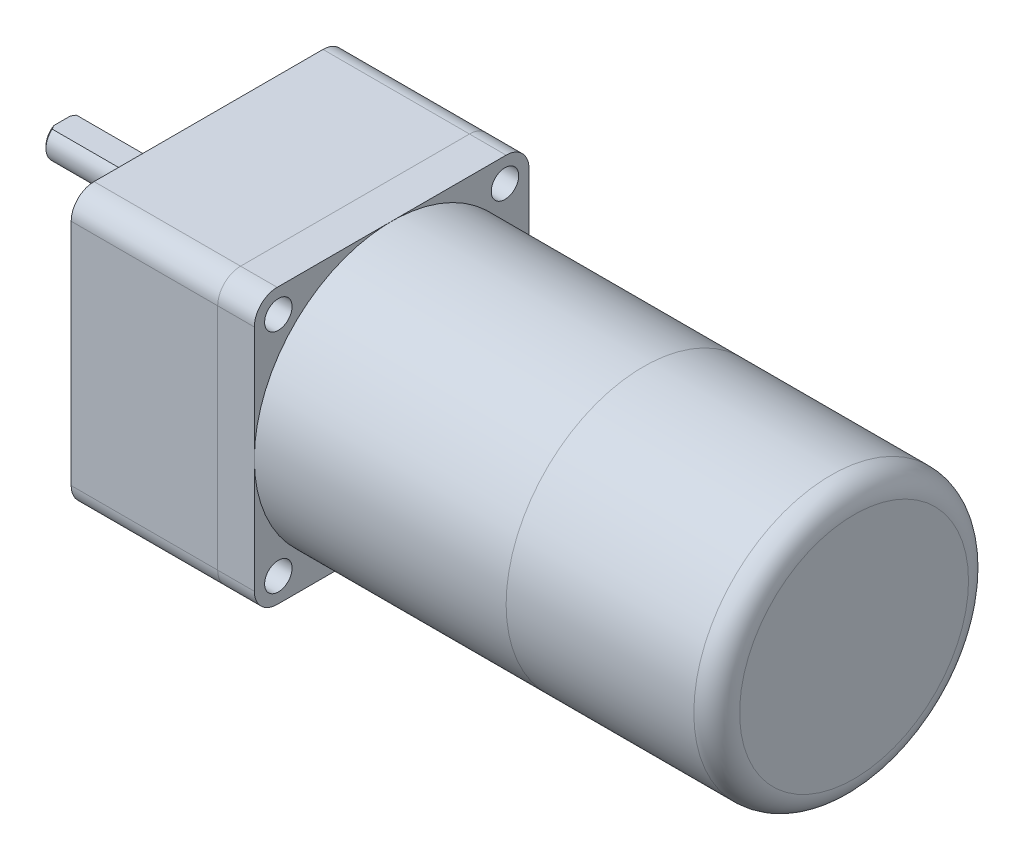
ISO-10303-21;
HEADER;
FILE_DESCRIPTION(('STEP AP214'),'2;1');
FILE_NAME('part.step','',(''),(''),'','','');
FILE_SCHEMA(('AUTOMOTIVE_DESIGN { 1 0 10303 214 1 1 1 1 }'));
ENDSEC;
DATA;
#1=APPLICATION_CONTEXT('core data for automotive mechanical design processes');
#2=APPLICATION_PROTOCOL_DEFINITION('international standard','automotive_design',2000,#1);
#3=PRODUCT_CONTEXT('',#1,'mechanical');
#4=PRODUCT('Part','Part','',(#3));
#5=PRODUCT_RELATED_PRODUCT_CATEGORY('part','',(#4));
#6=PRODUCT_DEFINITION_FORMATION('','',#4);
#7=PRODUCT_DEFINITION_CONTEXT('part definition',#1,'design');
#8=PRODUCT_DEFINITION('design','',#6,#7);
#9=PRODUCT_DEFINITION_SHAPE('','',#8);
#10=(LENGTH_UNIT() NAMED_UNIT(*) SI_UNIT(.MILLI.,.METRE.));
#11=(NAMED_UNIT(*) PLANE_ANGLE_UNIT() SI_UNIT($,.RADIAN.));
#12=(NAMED_UNIT(*) SI_UNIT($,.STERADIAN.) SOLID_ANGLE_UNIT());
#13=UNCERTAINTY_MEASURE_WITH_UNIT(LENGTH_MEASURE(1.E-05),#10,'distance_accuracy_value','');
#14=(GEOMETRIC_REPRESENTATION_CONTEXT(3) GLOBAL_UNCERTAINTY_ASSIGNED_CONTEXT((#13)) GLOBAL_UNIT_ASSIGNED_CONTEXT((#10,
#11,#12)) REPRESENTATION_CONTEXT('',''));
#15=CARTESIAN_POINT('',(0.,0.,0.));
#16=DIRECTION('',(0.,0.,1.));
#17=DIRECTION('',(1.,0.,0.));
#18=AXIS2_PLACEMENT_3D('',#15,#16,#17);
#19=CARTESIAN_POINT('',(-32.,10.,0.));
#20=DIRECTION('',(1.,0.,0.));
#21=DIRECTION('',(0.,0.,-1.));
#22=AXIS2_PLACEMENT_3D('',#19,#20,#21);
#23=CYLINDRICAL_SURFACE('',#22,4.);
#24=DIRECTION('',(-1.,0.,0.));
#25=VECTOR('',#24,1.);
#26=CARTESIAN_POINT('',(-7.,13.,2.64575131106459));
#27=LINE('',#26,#25);
#28=CARTESIAN_POINT('',(-7.,13.,2.64575131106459));
#29=VERTEX_POINT('',#28);
#30=CARTESIAN_POINT('',(-31.5,13.,2.64575131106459));
#31=VERTEX_POINT('',#30);
#32=EDGE_CURVE('E91',#29,#31,#27,.T.);
#33=ORIENTED_EDGE('',*,*,#32,.T.);
#34=CARTESIAN_POINT('',(-31.5,10.,0.));
#35=DIRECTION('',(-1.,0.,0.));
#36=DIRECTION('',(0.,0.,1.));
#37=AXIS2_PLACEMENT_3D('',#34,#35,#36);
#38=CIRCLE('',#37,4.);
#39=CARTESIAN_POINT('',(-31.5,13.,-2.64575131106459));
#40=VERTEX_POINT('',#39);
#41=EDGE_CURVE('E12',#31,#40,#38,.F.);
#42=ORIENTED_EDGE('',*,*,#41,.T.);
#43=DIRECTION('',(-1.,0.,0.));
#44=VECTOR('',#43,1.);
#45=CARTESIAN_POINT('',(-7.,13.,-2.64575131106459));
#46=LINE('',#45,#44);
#47=CARTESIAN_POINT('',(-7.,13.,-2.64575131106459));
#48=VERTEX_POINT('',#47);
#49=EDGE_CURVE('E89',#48,#40,#46,.T.);
#50=ORIENTED_EDGE('',*,*,#49,.F.);
#51=CARTESIAN_POINT('',(-7.,10.,0.));
#52=DIRECTION('',(-1.,0.,0.));
#53=DIRECTION('',(0.,0.,1.));
#54=AXIS2_PLACEMENT_3D('',#51,#52,#53);
#55=CIRCLE('',#54,4.);
#56=EDGE_CURVE('E82',#29,#48,#55,.T.);
#57=ORIENTED_EDGE('',*,*,#56,.F.);
#58=EDGE_LOOP('',(#33,#42,#50,#57));
#59=FACE_BOUND('',#58,.T.);
#60=CARTESIAN_POINT('',(-3.3,10.,0.));
#61=DIRECTION('',(-1.,0.,0.));
#62=DIRECTION('',(0.,0.,1.));
#63=AXIS2_PLACEMENT_3D('',#60,#61,#62);
#64=CIRCLE('',#63,4.);
#65=CARTESIAN_POINT('',(-3.3,10.,4.));
#66=VERTEX_POINT('',#65);
#67=EDGE_CURVE('E95',#66,#66,#64,.T.);
#68=ORIENTED_EDGE('',*,*,#67,.T.);
#69=EDGE_LOOP('',(#68));
#70=FACE_BOUND('',#69,.T.);
#71=ADVANCED_FACE('F48',(#59,#70),#23,.T.);
#72=CARTESIAN_POINT('',(-32.,10.,0.));
#73=DIRECTION('',(-1.,0.,0.));
#74=DIRECTION('',(0.,0.,1.));
#75=AXIS2_PLACEMENT_3D('',#72,#73,#74);
#76=PLANE('',#75);
#77=DIRECTION('',(0.,0.,1.));
#78=VECTOR('',#77,1.);
#79=CARTESIAN_POINT('',(-32.,13.,2.64575131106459));
#80=LINE('',#79,#78);
#81=CARTESIAN_POINT('',(-32.,13.,-1.80277563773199));
#82=VERTEX_POINT('',#81);
#83=CARTESIAN_POINT('',(-32.,13.,1.80277563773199));
#84=VERTEX_POINT('',#83);
#85=EDGE_CURVE('E86',#82,#84,#80,.T.);
#86=ORIENTED_EDGE('',*,*,#85,.F.);
#87=CARTESIAN_POINT('',(-32.,10.,0.));
#88=DIRECTION('',(-1.,0.,0.));
#89=DIRECTION('',(0.,0.,1.));
#90=AXIS2_PLACEMENT_3D('',#87,#88,#89);
#91=CIRCLE('',#90,3.5);
#92=EDGE_CURVE('E101',#82,#84,#91,.T.);
#93=ORIENTED_EDGE('',*,*,#92,.T.);
#94=EDGE_LOOP('',(#86,#93));
#95=FACE_BOUND('',#94,.T.);
#96=ADVANCED_FACE('F117',(#95),#76,.T.);
#97=CARTESIAN_POINT('',(-3.3,10.,0.));
#98=DIRECTION('',(-1.,0.,0.));
#99=DIRECTION('',(0.,0.,1.));
#100=AXIS2_PLACEMENT_3D('',#97,#98,#99);
#101=PLANE('',#100);
#102=ORIENTED_EDGE('',*,*,#67,.F.);
#103=EDGE_LOOP('',(#102));
#104=FACE_BOUND('',#103,.T.);
#105=ADVANCED_FACE('F116',(#104),#101,.F.);
#106=CARTESIAN_POINT('',(-7.,13.,2.64575131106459));
#107=DIRECTION('',(0.,-1.,0.));
#108=DIRECTION('',(0.,0.,-1.));
#109=AXIS2_PLACEMENT_3D('',#106,#107,#108);
#110=PLANE('',#109);
#111=ORIENTED_EDGE('',*,*,#85,.T.);
#112=CARTESIAN_POINT('',(-32.,13.,1.80277563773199));
#113=CARTESIAN_POINT('',(-31.962552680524,13.,1.87545495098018));
#114=CARTESIAN_POINT('',(-31.9238154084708,13.,1.94745530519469));
#115=CARTESIAN_POINT('',(-31.8441464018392,13.,2.09016482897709));
#116=CARTESIAN_POINT('',(-31.8032162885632,13.,2.16087490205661));
#117=CARTESIAN_POINT('',(-31.7194976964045,13.,2.30116567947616));
#118=CARTESIAN_POINT('',(-31.6767094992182,13.,2.37074655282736));
#119=CARTESIAN_POINT('',(-31.5895037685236,13.,2.50895192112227));
#120=CARTESIAN_POINT('',(-31.5450850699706,13.,2.57757568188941));
#121=CARTESIAN_POINT('',(-31.5,13.,2.64575131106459));
#122=B_SPLINE_CURVE_WITH_KNOTS('',3,(#112,#113,#114,#115,#116,#117,#118,#119,#120,#121),
.UNSPECIFIED.,.F.,.F.,(4,2,2,2,4),(0.,0.245246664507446,0.490314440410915,0.735345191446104,
0.980554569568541),.UNSPECIFIED.);
#123=EDGE_CURVE('E57',#84,#31,#122,.T.);
#124=ORIENTED_EDGE('',*,*,#123,.T.);
#125=ORIENTED_EDGE('',*,*,#32,.F.);
#126=DIRECTION('',(0.,0.,1.));
#127=VECTOR('',#126,1.);
#128=CARTESIAN_POINT('',(-7.,13.,2.64575131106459));
#129=LINE('',#128,#127);
#130=EDGE_CURVE('E85',#48,#29,#129,.T.);
#131=ORIENTED_EDGE('',*,*,#130,.F.);
#132=ORIENTED_EDGE('',*,*,#49,.T.);
#133=CARTESIAN_POINT('',(-31.5,13.,-2.64575131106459));
#134=CARTESIAN_POINT('',(-31.5450850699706,13.,-2.57757568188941));
#135=CARTESIAN_POINT('',(-31.5895037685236,13.,-2.50895192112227));
#136=CARTESIAN_POINT('',(-31.6767094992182,13.,-2.37074655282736));
#137=CARTESIAN_POINT('',(-31.7194976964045,13.,-2.30116567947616));
#138=CARTESIAN_POINT('',(-31.8032162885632,13.,-2.16087490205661));
#139=CARTESIAN_POINT('',(-31.8441464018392,13.,-2.09016482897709));
#140=CARTESIAN_POINT('',(-31.9238154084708,13.,-1.94745530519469));
#141=CARTESIAN_POINT('',(-31.962552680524,13.,-1.87545495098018));
#142=CARTESIAN_POINT('',(-32.,13.,-1.80277563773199));
#143=B_SPLINE_CURVE_WITH_KNOTS('',3,(#133,#134,#135,#136,#137,#138,#139,#140,#141,#142),
.UNSPECIFIED.,.F.,.F.,(4,2,2,2,4),(0.,0.245209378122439,0.490240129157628,0.735307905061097,
0.980554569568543),.UNSPECIFIED.);
#144=EDGE_CURVE('E104',#40,#82,#143,.T.);
#145=ORIENTED_EDGE('',*,*,#144,.T.);
#146=EDGE_LOOP('',(#111,#124,#125,#131,#132,#145));
#147=FACE_BOUND('',#146,.T.);
#148=ADVANCED_FACE('F88',(#147),#110,.F.);
#149=CARTESIAN_POINT('',(-7.,10.,0.));
#150=DIRECTION('',(-1.,0.,0.));
#151=DIRECTION('',(0.,0.,1.));
#152=AXIS2_PLACEMENT_3D('',#149,#150,#151);
#153=PLANE('',#152);
#154=ORIENTED_EDGE('',*,*,#56,.T.);
#155=ORIENTED_EDGE('',*,*,#130,.T.);
#156=EDGE_LOOP('',(#154,#155));
#157=FACE_BOUND('',#156,.T.);
#158=ADVANCED_FACE('F84',(#157),#153,.T.);
#159=CARTESIAN_POINT('',(-32.,10.,0.));
#160=DIRECTION('',(1.,0.,0.));
#161=DIRECTION('',(0.,0.,-1.));
#162=AXIS2_PLACEMENT_3D('',#159,#160,#161);
#163=CONICAL_SURFACE('',#162,3.5,0.785398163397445);
#164=ORIENTED_EDGE('',*,*,#144,.F.);
#165=ORIENTED_EDGE('',*,*,#41,.F.);
#166=ORIENTED_EDGE('',*,*,#123,.F.);
#167=ORIENTED_EDGE('',*,*,#92,.F.);
#168=EDGE_LOOP('',(#164,#165,#166,#167));
#169=FACE_BOUND('',#168,.T.);
#170=ADVANCED_FACE('F50',(#169),#163,.T.);
#171=CLOSED_SHELL('',(#71,#96,#105,#148,#158,#170));
#172=MANIFOLD_SOLID_BREP('B2',#171);
#173=CARTESIAN_POINT('',(-3.3,10.,0.));
#174=DIRECTION('',(1.,0.,0.));
#175=DIRECTION('',(0.,0.,-1.));
#176=AXIS2_PLACEMENT_3D('',#173,#174,#175);
#177=CYLINDRICAL_SURFACE('',#176,12.);
#178=CARTESIAN_POINT('',(-2.8,10.,0.));
#179=DIRECTION('',(-1.,0.,0.));
#180=DIRECTION('',(0.,0.,1.));
#181=AXIS2_PLACEMENT_3D('',#178,#179,#180);
#182=CIRCLE('',#181,12.);
#183=CARTESIAN_POINT('',(-2.8,10.,12.));
#184=VERTEX_POINT('',#183);
#185=EDGE_CURVE('E47',#184,#184,#182,.F.);
#186=ORIENTED_EDGE('',*,*,#185,.T.);
#187=EDGE_LOOP('',(#186));
#188=FACE_BOUND('',#187,.T.);
#189=CARTESIAN_POINT('',(0.,10.,0.));
#190=DIRECTION('',(-1.,0.,0.));
#191=DIRECTION('',(0.,0.,1.));
#192=AXIS2_PLACEMENT_3D('',#189,#190,#191);
#193=CIRCLE('',#192,12.);
#194=CARTESIAN_POINT('',(0.,10.,12.));
#195=VERTEX_POINT('',#194);
#196=EDGE_CURVE('E190',#195,#195,#193,.T.);
#197=ORIENTED_EDGE('',*,*,#196,.T.);
#198=EDGE_LOOP('',(#197));
#199=FACE_BOUND('',#198,.T.);
#200=ADVANCED_FACE('F179',(#188,#199),#177,.T.);
#201=CARTESIAN_POINT('',(-3.3,10.,0.));
#202=DIRECTION('',(-1.,0.,0.));
#203=DIRECTION('',(0.,0.,1.));
#204=AXIS2_PLACEMENT_3D('',#201,#202,#203);
#205=PLANE('',#204);
#206=CARTESIAN_POINT('',(-3.3,10.,0.));
#207=DIRECTION('',(-1.,0.,0.));
#208=DIRECTION('',(0.,0.,1.));
#209=AXIS2_PLACEMENT_3D('',#206,#207,#208);
#210=CIRCLE('',#209,11.5);
#211=CARTESIAN_POINT('',(-3.3,10.,11.5));
#212=VERTEX_POINT('',#211);
#213=EDGE_CURVE('E186',#212,#212,#210,.T.);
#214=ORIENTED_EDGE('',*,*,#213,.T.);
#215=EDGE_LOOP('',(#214));
#216=FACE_BOUND('',#215,.T.);
#217=ADVANCED_FACE('F200',(#216),#205,.T.);
#218=CARTESIAN_POINT('',(0.,10.,0.));
#219=DIRECTION('',(-1.,0.,0.));
#220=DIRECTION('',(0.,0.,1.));
#221=AXIS2_PLACEMENT_3D('',#218,#219,#220);
#222=PLANE('',#221);
#223=ORIENTED_EDGE('',*,*,#196,.F.);
#224=EDGE_LOOP('',(#223));
#225=FACE_BOUND('',#224,.T.);
#226=ADVANCED_FACE('F198',(#225),#222,.F.);
#227=CARTESIAN_POINT('',(-2.8,10.,0.));
#228=DIRECTION('',(-1.,0.,0.));
#229=DIRECTION('',(0.,0.,1.));
#230=AXIS2_PLACEMENT_3D('',#227,#228,#229);
#231=TOROIDAL_SURFACE('',#230,11.5,0.5);
#232=ORIENTED_EDGE('',*,*,#185,.F.);
#233=EDGE_LOOP('',(#232));
#234=FACE_BOUND('',#233,.T.);
#235=ORIENTED_EDGE('',*,*,#213,.F.);
#236=EDGE_LOOP('',(#235));
#237=FACE_BOUND('',#236,.T.);
#238=ADVANCED_FACE('F181',(#234,#237),#231,.T.);
#239=CLOSED_SHELL('',(#200,#217,#226,#238));
#240=MANIFOLD_SOLID_BREP('B6',#239);
#241=CARTESIAN_POINT('',(141.,0.,0.));
#242=DIRECTION('',(-1.,0.,0.));
#243=DIRECTION('',(0.,0.,1.));
#244=AXIS2_PLACEMENT_3D('',#241,#242,#243);
#245=CYLINDRICAL_SURFACE('',#244,30.);
#246=CARTESIAN_POINT('',(136.,0.,0.));
#247=DIRECTION('',(1.,0.,0.));
#248=DIRECTION('',(0.,0.,-1.));
#249=AXIS2_PLACEMENT_3D('',#246,#247,#248);
#250=CIRCLE('',#249,30.);
#251=CARTESIAN_POINT('',(136.,0.,-30.));
#252=VERTEX_POINT('',#251);
#253=EDGE_CURVE('E178',#252,#252,#250,.F.);
#254=ORIENTED_EDGE('',*,*,#253,.T.);
#255=EDGE_LOOP('',(#254));
#256=FACE_BOUND('',#255,.T.);
#257=CARTESIAN_POINT('',(95.,0.,0.));
#258=DIRECTION('',(1.,0.,0.));
#259=DIRECTION('',(0.,0.,-1.));
#260=AXIS2_PLACEMENT_3D('',#257,#258,#259);
#261=CIRCLE('',#260,30.);
#262=CARTESIAN_POINT('',(95.,0.,-30.));
#263=VERTEX_POINT('',#262);
#264=EDGE_CURVE('E254',#263,#263,#261,.T.);
#265=ORIENTED_EDGE('',*,*,#264,.T.);
#266=EDGE_LOOP('',(#265));
#267=FACE_BOUND('',#266,.T.);
#268=ADVANCED_FACE('F243',(#256,#267),#245,.T.);
#269=CARTESIAN_POINT('',(141.,0.,0.));
#270=DIRECTION('',(1.,0.,0.));
#271=DIRECTION('',(0.,0.,-1.));
#272=AXIS2_PLACEMENT_3D('',#269,#270,#271);
#273=PLANE('',#272);
#274=CARTESIAN_POINT('',(141.,0.,0.));
#275=DIRECTION('',(1.,0.,0.));
#276=DIRECTION('',(0.,0.,-1.));
#277=AXIS2_PLACEMENT_3D('',#274,#275,#276);
#278=CIRCLE('',#277,25.);
#279=CARTESIAN_POINT('',(141.,0.,-25.));
#280=VERTEX_POINT('',#279);
#281=EDGE_CURVE('E250',#280,#280,#278,.T.);
#282=ORIENTED_EDGE('',*,*,#281,.T.);
#283=EDGE_LOOP('',(#282));
#284=FACE_BOUND('',#283,.T.);
#285=ADVANCED_FACE('F264',(#284),#273,.T.);
#286=CARTESIAN_POINT('',(95.,0.,0.));
#287=DIRECTION('',(1.,0.,0.));
#288=DIRECTION('',(0.,0.,-1.));
#289=AXIS2_PLACEMENT_3D('',#286,#287,#288);
#290=PLANE('',#289);
#291=ORIENTED_EDGE('',*,*,#264,.F.);
#292=EDGE_LOOP('',(#291));
#293=FACE_BOUND('',#292,.T.);
#294=ADVANCED_FACE('F262',(#293),#290,.F.);
#295=CARTESIAN_POINT('',(136.,0.,0.));
#296=DIRECTION('',(1.,0.,0.));
#297=DIRECTION('',(0.,0.,-1.));
#298=AXIS2_PLACEMENT_3D('',#295,#296,#297);
#299=TOROIDAL_SURFACE('',#298,25.,5.);
#300=ORIENTED_EDGE('',*,*,#253,.F.);
#301=EDGE_LOOP('',(#300));
#302=FACE_BOUND('',#301,.T.);
#303=ORIENTED_EDGE('',*,*,#281,.F.);
#304=EDGE_LOOP('',(#303));
#305=FACE_BOUND('',#304,.T.);
#306=ADVANCED_FACE('F245',(#302,#305),#299,.T.);
#307=CLOSED_SHELL('',(#268,#285,#294,#306));
#308=MANIFOLD_SOLID_BREP('B42',#307);
#309=CARTESIAN_POINT('',(95.,0.,0.));
#310=DIRECTION('',(-1.,0.,0.));
#311=DIRECTION('',(0.,0.,1.));
#312=AXIS2_PLACEMENT_3D('',#309,#310,#311);
#313=CYLINDRICAL_SURFACE('',#312,30.);
#314=CARTESIAN_POINT('',(95.,0.,0.));
#315=DIRECTION('',(1.,0.,0.));
#316=DIRECTION('',(0.,0.,-1.));
#317=AXIS2_PLACEMENT_3D('',#314,#315,#316);
#318=CIRCLE('',#317,30.);
#319=CARTESIAN_POINT('',(95.,0.,-30.));
#320=VERTEX_POINT('',#319);
#321=EDGE_CURVE('E242',#320,#320,#318,.T.);
#322=ORIENTED_EDGE('',*,*,#321,.F.);
#323=EDGE_LOOP('',(#322));
#324=FACE_BOUND('',#323,.T.);
#325=CARTESIAN_POINT('',(40.,0.,0.));
#326=DIRECTION('',(1.,0.,0.));
#327=DIRECTION('',(0.,0.,-1.));
#328=AXIS2_PLACEMENT_3D('',#325,#326,#327);
#329=CIRCLE('',#328,30.);
#330=CARTESIAN_POINT('',(40.,0.,-30.));
#331=VERTEX_POINT('',#330);
#332=EDGE_CURVE('E312',#331,#331,#329,.T.);
#333=ORIENTED_EDGE('',*,*,#332,.T.);
#334=EDGE_LOOP('',(#333));
#335=FACE_BOUND('',#334,.T.);
#336=ADVANCED_FACE('F309',(#324,#335),#313,.T.);
#337=CARTESIAN_POINT('',(95.,0.,0.));
#338=DIRECTION('',(1.,0.,0.));
#339=DIRECTION('',(0.,0.,-1.));
#340=AXIS2_PLACEMENT_3D('',#337,#338,#339);
#341=PLANE('',#340);
#342=ORIENTED_EDGE('',*,*,#321,.T.);
#343=EDGE_LOOP('',(#342));
#344=FACE_BOUND('',#343,.T.);
#345=ADVANCED_FACE('F324',(#344),#341,.T.);
#346=CARTESIAN_POINT('',(40.,0.,0.));
#347=DIRECTION('',(1.,0.,0.));
#348=DIRECTION('',(0.,0.,-1.));
#349=AXIS2_PLACEMENT_3D('',#346,#347,#348);
#350=PLANE('',#349);
#351=ORIENTED_EDGE('',*,*,#332,.F.);
#352=EDGE_LOOP('',(#351));
#353=FACE_BOUND('',#352,.T.);
#354=ADVANCED_FACE('F322',(#353),#350,.F.);
#355=CLOSED_SHELL('',(#336,#345,#354));
#356=MANIFOLD_SOLID_BREP('B173',#355);
#357=CARTESIAN_POINT('',(40.,-25.,25.));
#358=DIRECTION('',(-1.,0.,0.));
#359=DIRECTION('',(0.,0.,1.));
#360=AXIS2_PLACEMENT_3D('',#357,#358,#359);
#361=CYLINDRICAL_SURFACE('',#360,5.);
#362=CARTESIAN_POINT('',(32.,-25.,25.));
#363=DIRECTION('',(1.,0.,0.));
#364=DIRECTION('',(0.,0.,1.));
#365=AXIS2_PLACEMENT_3D('',#362,#363,#364);
#366=CIRCLE('',#365,5.);
#367=CARTESIAN_POINT('',(32.,-25.,30.));
#368=VERTEX_POINT('',#367);
#369=CARTESIAN_POINT('',(32.,-30.,25.));
#370=VERTEX_POINT('',#369);
#371=EDGE_CURVE('E457',#368,#370,#366,.T.);
#372=ORIENTED_EDGE('',*,*,#371,.T.);
#373=DIRECTION('',(-1.,0.,0.));
#374=VECTOR('',#373,1.);
#375=CARTESIAN_POINT('',(40.,-30.,25.));
#376=LINE('',#375,#374);
#377=CARTESIAN_POINT('',(40.,-30.,25.));
#378=VERTEX_POINT('',#377);
#379=EDGE_CURVE('E307',#378,#370,#376,.T.);
#380=ORIENTED_EDGE('',*,*,#379,.F.);
#381=CARTESIAN_POINT('',(40.,-25.,25.));
#382=DIRECTION('',(1.,0.,0.));
#383=DIRECTION('',(0.,0.,1.));
#384=AXIS2_PLACEMENT_3D('',#381,#382,#383);
#385=CIRCLE('',#384,5.);
#386=CARTESIAN_POINT('',(40.,-25.,30.));
#387=VERTEX_POINT('',#386);
#388=EDGE_CURVE('E471',#387,#378,#385,.T.);
#389=ORIENTED_EDGE('',*,*,#388,.F.);
#390=DIRECTION('',(-1.,0.,0.));
#391=VECTOR('',#390,1.);
#392=CARTESIAN_POINT('',(40.,-25.,30.));
#393=LINE('',#392,#391);
#394=EDGE_CURVE('E453',#387,#368,#393,.T.);
#395=ORIENTED_EDGE('',*,*,#394,.T.);
#396=EDGE_LOOP('',(#372,#380,#389,#395));
#397=FACE_BOUND('',#396,.T.);
#398=ADVANCED_FACE('F359',(#397),#361,.T.);
#399=CARTESIAN_POINT('',(40.,-30.,25.));
#400=DIRECTION('',(0.,1.,0.));
#401=DIRECTION('',(0.,0.,1.));
#402=AXIS2_PLACEMENT_3D('',#399,#400,#401);
#403=PLANE('',#402);
#404=DIRECTION('',(0.,0.,-1.));
#405=VECTOR('',#404,1.);
#406=CARTESIAN_POINT('',(32.,-30.,25.));
#407=LINE('',#406,#405);
#408=CARTESIAN_POINT('',(32.,-30.,-25.));
#409=VERTEX_POINT('',#408);
#410=EDGE_CURVE('E460',#370,#409,#407,.T.);
#411=ORIENTED_EDGE('',*,*,#410,.T.);
#412=DIRECTION('',(-1.,0.,0.));
#413=VECTOR('',#412,1.);
#414=CARTESIAN_POINT('',(40.,-30.,-25.));
#415=LINE('',#414,#413);
#416=CARTESIAN_POINT('',(40.,-30.,-25.));
#417=VERTEX_POINT('',#416);
#418=EDGE_CURVE('E368',#417,#409,#415,.T.);
#419=ORIENTED_EDGE('',*,*,#418,.F.);
#420=DIRECTION('',(0.,0.,-1.));
#421=VECTOR('',#420,1.);
#422=CARTESIAN_POINT('',(40.,-30.,25.));
#423=LINE('',#422,#421);
#424=EDGE_CURVE('E420',#378,#417,#423,.T.);
#425=ORIENTED_EDGE('',*,*,#424,.F.);
#426=ORIENTED_EDGE('',*,*,#379,.T.);
#427=EDGE_LOOP('',(#411,#419,#425,#426));
#428=FACE_BOUND('',#427,.T.);
#429=ADVANCED_FACE('F525',(#428),#403,.F.);
#430=CARTESIAN_POINT('',(40.,-25.,-25.));
#431=DIRECTION('',(-1.,0.,0.));
#432=DIRECTION('',(0.,0.,1.));
#433=AXIS2_PLACEMENT_3D('',#430,#431,#432);
#434=CYLINDRICAL_SURFACE('',#433,5.);
#435=CARTESIAN_POINT('',(32.,-25.,-25.));
#436=DIRECTION('',(1.,0.,0.));
#437=DIRECTION('',(0.,0.,-1.));
#438=AXIS2_PLACEMENT_3D('',#435,#436,#437);
#439=CIRCLE('',#438,5.);
#440=CARTESIAN_POINT('',(32.,-25.,-30.));
#441=VERTEX_POINT('',#440);
#442=EDGE_CURVE('E462',#409,#441,#439,.T.);
#443=ORIENTED_EDGE('',*,*,#442,.T.);
#444=DIRECTION('',(-1.,0.,0.));
#445=VECTOR('',#444,1.);
#446=CARTESIAN_POINT('',(40.,-25.,-30.));
#447=LINE('',#446,#445);
#448=CARTESIAN_POINT('',(40.,-25.,-30.));
#449=VERTEX_POINT('',#448);
#450=EDGE_CURVE('E478',#449,#441,#447,.T.);
#451=ORIENTED_EDGE('',*,*,#450,.F.);
#452=CARTESIAN_POINT('',(40.,-25.,-25.));
#453=DIRECTION('',(1.,0.,0.));
#454=DIRECTION('',(0.,0.,-1.));
#455=AXIS2_PLACEMENT_3D('',#452,#453,#454);
#456=CIRCLE('',#455,5.);
#457=EDGE_CURVE('E626',#417,#449,#456,.T.);
#458=ORIENTED_EDGE('',*,*,#457,.F.);
#459=ORIENTED_EDGE('',*,*,#418,.T.);
#460=EDGE_LOOP('',(#443,#451,#458,#459));
#461=FACE_BOUND('',#460,.T.);
#462=ADVANCED_FACE('F529',(#461),#434,.T.);
#463=CARTESIAN_POINT('',(40.,-25.,-30.));
#464=DIRECTION('',(0.,0.,1.));
#465=DIRECTION('',(1.,0.,0.));
#466=AXIS2_PLACEMENT_3D('',#463,#464,#465);
#467=PLANE('',#466);
#468=DIRECTION('',(0.,1.,0.));
#469=VECTOR('',#468,1.);
#470=CARTESIAN_POINT('',(32.,-25.,-30.));
#471=LINE('',#470,#469);
#472=CARTESIAN_POINT('',(32.,25.,-30.));
#473=VERTEX_POINT('',#472);
#474=EDGE_CURVE('E464',#441,#473,#471,.T.);
#475=ORIENTED_EDGE('',*,*,#474,.T.);
#476=DIRECTION('',(-1.,0.,0.));
#477=VECTOR('',#476,1.);
#478=CARTESIAN_POINT('',(40.,25.,-30.));
#479=LINE('',#478,#477);
#480=CARTESIAN_POINT('',(40.,25.,-30.));
#481=VERTEX_POINT('',#480);
#482=EDGE_CURVE('E475',#481,#473,#479,.T.);
#483=ORIENTED_EDGE('',*,*,#482,.F.);
#484=DIRECTION('',(0.,1.,0.));
#485=VECTOR('',#484,1.);
#486=CARTESIAN_POINT('',(40.,-25.,-30.));
#487=LINE('',#486,#485);
#488=EDGE_CURVE('E628',#449,#481,#487,.T.);
#489=ORIENTED_EDGE('',*,*,#488,.F.);
#490=ORIENTED_EDGE('',*,*,#450,.T.);
#491=EDGE_LOOP('',(#475,#483,#489,#490));
#492=FACE_BOUND('',#491,.T.);
#493=ADVANCED_FACE('F533',(#492),#467,.F.);
#494=CARTESIAN_POINT('',(40.,25.,-25.));
#495=DIRECTION('',(-1.,0.,0.));
#496=DIRECTION('',(0.,0.,1.));
#497=AXIS2_PLACEMENT_3D('',#494,#495,#496);
#498=CYLINDRICAL_SURFACE('',#497,5.);
#499=CARTESIAN_POINT('',(32.,25.,-25.));
#500=DIRECTION('',(1.,0.,0.));
#501=DIRECTION('',(0.,0.,1.));
#502=AXIS2_PLACEMENT_3D('',#499,#500,#501);
#503=CIRCLE('',#502,5.);
#504=CARTESIAN_POINT('',(32.,30.,-25.));
#505=VERTEX_POINT('',#504);
#506=EDGE_CURVE('E466',#473,#505,#503,.T.);
#507=ORIENTED_EDGE('',*,*,#506,.T.);
#508=DIRECTION('',(-1.,0.,0.));
#509=VECTOR('',#508,1.);
#510=CARTESIAN_POINT('',(40.,30.,-25.));
#511=LINE('',#510,#509);
#512=CARTESIAN_POINT('',(40.,30.,-25.));
#513=VERTEX_POINT('',#512);
#514=EDGE_CURVE('E448',#513,#505,#511,.T.);
#515=ORIENTED_EDGE('',*,*,#514,.F.);
#516=CARTESIAN_POINT('',(40.,25.,-25.));
#517=DIRECTION('',(1.,0.,0.));
#518=DIRECTION('',(0.,0.,1.));
#519=AXIS2_PLACEMENT_3D('',#516,#517,#518);
#520=CIRCLE('',#519,5.);
#521=EDGE_CURVE('E439',#481,#513,#520,.T.);
#522=ORIENTED_EDGE('',*,*,#521,.F.);
#523=ORIENTED_EDGE('',*,*,#482,.T.);
#524=EDGE_LOOP('',(#507,#515,#522,#523));
#525=FACE_BOUND('',#524,.T.);
#526=ADVANCED_FACE('F539',(#525),#498,.T.);
#527=CARTESIAN_POINT('',(40.,30.,25.));
#528=DIRECTION('',(0.,-1.,0.));
#529=DIRECTION('',(0.,0.,-1.));
#530=AXIS2_PLACEMENT_3D('',#527,#528,#529);
#531=PLANE('',#530);
#532=DIRECTION('',(0.,0.,1.));
#533=VECTOR('',#532,1.);
#534=CARTESIAN_POINT('',(32.,30.,25.));
#535=LINE('',#534,#533);
#536=CARTESIAN_POINT('',(32.,30.,25.));
#537=VERTEX_POINT('',#536);
#538=EDGE_CURVE('E447',#505,#537,#535,.T.);
#539=ORIENTED_EDGE('',*,*,#538,.T.);
#540=DIRECTION('',(-1.,0.,0.));
#541=VECTOR('',#540,1.);
#542=CARTESIAN_POINT('',(40.,30.,25.));
#543=LINE('',#542,#541);
#544=CARTESIAN_POINT('',(40.,30.,25.));
#545=VERTEX_POINT('',#544);
#546=EDGE_CURVE('E444',#545,#537,#543,.T.);
#547=ORIENTED_EDGE('',*,*,#546,.F.);
#548=DIRECTION('',(0.,0.,1.));
#549=VECTOR('',#548,1.);
#550=CARTESIAN_POINT('',(40.,30.,25.));
#551=LINE('',#550,#549);
#552=EDGE_CURVE('E433',#513,#545,#551,.T.);
#553=ORIENTED_EDGE('',*,*,#552,.F.);
#554=ORIENTED_EDGE('',*,*,#514,.T.);
#555=EDGE_LOOP('',(#539,#547,#553,#554));
#556=FACE_BOUND('',#555,.T.);
#557=ADVANCED_FACE('F445',(#556),#531,.F.);
#558=CARTESIAN_POINT('',(40.,25.,25.));
#559=DIRECTION('',(-1.,0.,0.));
#560=DIRECTION('',(0.,0.,1.));
#561=AXIS2_PLACEMENT_3D('',#558,#559,#560);
#562=CYLINDRICAL_SURFACE('',#561,5.);
#563=CARTESIAN_POINT('',(32.,25.,25.));
#564=DIRECTION('',(1.,0.,0.));
#565=DIRECTION('',(0.,0.,1.));
#566=AXIS2_PLACEMENT_3D('',#563,#564,#565);
#567=CIRCLE('',#566,5.);
#568=CARTESIAN_POINT('',(32.,25.,30.));
#569=VERTEX_POINT('',#568);
#570=EDGE_CURVE('E406',#537,#569,#567,.T.);
#571=ORIENTED_EDGE('',*,*,#570,.T.);
#572=DIRECTION('',(-1.,0.,0.));
#573=VECTOR('',#572,1.);
#574=CARTESIAN_POINT('',(40.,25.,30.));
#575=LINE('',#574,#573);
#576=CARTESIAN_POINT('',(40.,25.,30.));
#577=VERTEX_POINT('',#576);
#578=EDGE_CURVE('E449',#577,#569,#575,.T.);
#579=ORIENTED_EDGE('',*,*,#578,.F.);
#580=CARTESIAN_POINT('',(40.,25.,25.));
#581=DIRECTION('',(1.,0.,0.));
#582=DIRECTION('',(0.,0.,1.));
#583=AXIS2_PLACEMENT_3D('',#580,#581,#582);
#584=CIRCLE('',#583,5.);
#585=EDGE_CURVE('E437',#545,#577,#584,.T.);
#586=ORIENTED_EDGE('',*,*,#585,.F.);
#587=ORIENTED_EDGE('',*,*,#546,.T.);
#588=EDGE_LOOP('',(#571,#579,#586,#587));
#589=FACE_BOUND('',#588,.T.);
#590=ADVANCED_FACE('F451',(#589),#562,.T.);
#591=CARTESIAN_POINT('',(40.,-25.,30.));
#592=DIRECTION('',(0.,0.,-1.));
#593=DIRECTION('',(-1.,0.,0.));
#594=AXIS2_PLACEMENT_3D('',#591,#592,#593);
#595=PLANE('',#594);
#596=DIRECTION('',(0.,-1.,0.));
#597=VECTOR('',#596,1.);
#598=CARTESIAN_POINT('',(32.,-25.,30.));
#599=LINE('',#598,#597);
#600=EDGE_CURVE('E412',#569,#368,#599,.T.);
#601=ORIENTED_EDGE('',*,*,#600,.T.);
#602=ORIENTED_EDGE('',*,*,#394,.F.);
#603=DIRECTION('',(0.,-1.,0.));
#604=VECTOR('',#603,1.);
#605=CARTESIAN_POINT('',(40.,-25.,30.));
#606=LINE('',#605,#604);
#607=EDGE_CURVE('E377',#577,#387,#606,.T.);
#608=ORIENTED_EDGE('',*,*,#607,.F.);
#609=ORIENTED_EDGE('',*,*,#578,.T.);
#610=EDGE_LOOP('',(#601,#602,#608,#609));
#611=FACE_BOUND('',#610,.T.);
#612=ADVANCED_FACE('F514',(#611),#595,.F.);
#613=CARTESIAN_POINT('',(40.,-25.,25.));
#614=DIRECTION('',(-1.,0.,0.));
#615=DIRECTION('',(0.,0.,1.));
#616=AXIS2_PLACEMENT_3D('',#613,#614,#615);
#617=PLANE('',#616);
#618=CARTESIAN_POINT('',(40.,24.7487373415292,24.7487373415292));
#619=DIRECTION('',(1.,0.,0.));
#620=DIRECTION('',(0.,0.,-1.));
#621=AXIS2_PLACEMENT_3D('',#618,#619,#620);
#622=CIRCLE('',#621,3.);
#623=CARTESIAN_POINT('',(40.,24.7487373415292,21.7487373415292));
#624=VERTEX_POINT('',#623);
#625=EDGE_CURVE('E487',#624,#624,#622,.T.);
#626=ORIENTED_EDGE('',*,*,#625,.F.);
#627=EDGE_LOOP('',(#626));
#628=FACE_BOUND('',#627,.T.);
#629=CARTESIAN_POINT('',(40.,24.7487373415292,-24.7487373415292));
#630=DIRECTION('',(1.,0.,0.));
#631=DIRECTION('',(0.,0.,-1.));
#632=AXIS2_PLACEMENT_3D('',#629,#630,#631);
#633=CIRCLE('',#632,3.);
#634=CARTESIAN_POINT('',(40.,24.7487373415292,-27.7487373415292));
#635=VERTEX_POINT('',#634);
#636=EDGE_CURVE('E612',#635,#635,#633,.T.);
#637=ORIENTED_EDGE('',*,*,#636,.F.);
#638=EDGE_LOOP('',(#637));
#639=FACE_BOUND('',#638,.T.);
#640=CARTESIAN_POINT('',(40.,-24.7487373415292,-24.7487373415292));
#641=DIRECTION('',(1.,0.,0.));
#642=DIRECTION('',(0.,0.,-1.));
#643=AXIS2_PLACEMENT_3D('',#640,#641,#642);
#644=CIRCLE('',#643,3.);
#645=CARTESIAN_POINT('',(40.,-24.7487373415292,-27.7487373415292));
#646=VERTEX_POINT('',#645);
#647=EDGE_CURVE('E614',#646,#646,#644,.T.);
#648=ORIENTED_EDGE('',*,*,#647,.F.);
#649=EDGE_LOOP('',(#648));
#650=FACE_BOUND('',#649,.T.);
#651=CARTESIAN_POINT('',(40.,-24.7487373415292,24.7487373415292));
#652=DIRECTION('',(1.,0.,0.));
#653=DIRECTION('',(0.,0.,-1.));
#654=AXIS2_PLACEMENT_3D('',#651,#652,#653);
#655=CIRCLE('',#654,3.);
#656=CARTESIAN_POINT('',(40.,-24.7487373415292,21.7487373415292));
#657=VERTEX_POINT('',#656);
#658=EDGE_CURVE('E619',#657,#657,#655,.T.);
#659=ORIENTED_EDGE('',*,*,#658,.F.);
#660=EDGE_LOOP('',(#659));
#661=FACE_BOUND('',#660,.T.);
#662=ORIENTED_EDGE('',*,*,#388,.T.);
#663=ORIENTED_EDGE('',*,*,#424,.T.);
#664=ORIENTED_EDGE('',*,*,#457,.T.);
#665=ORIENTED_EDGE('',*,*,#488,.T.);
#666=ORIENTED_EDGE('',*,*,#521,.T.);
#667=ORIENTED_EDGE('',*,*,#552,.T.);
#668=ORIENTED_EDGE('',*,*,#585,.T.);
#669=ORIENTED_EDGE('',*,*,#607,.T.);
#670=EDGE_LOOP('',(#662,#663,#664,#665,#666,#667,#668,#669));
#671=FACE_BOUND('',#670,.T.);
#672=ADVANCED_FACE('F435',(#628,#639,#650,#661,#671),#617,.F.);
#673=CARTESIAN_POINT('',(32.,-25.,25.));
#674=DIRECTION('',(-1.,0.,0.));
#675=DIRECTION('',(0.,0.,1.));
#676=AXIS2_PLACEMENT_3D('',#673,#674,#675);
#677=PLANE('',#676);
#678=CARTESIAN_POINT('',(32.,24.7487373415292,24.7487373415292));
#679=DIRECTION('',(-1.,0.,0.));
#680=DIRECTION('',(0.,0.,1.));
#681=AXIS2_PLACEMENT_3D('',#678,#679,#680);
#682=CIRCLE('',#681,3.);
#683=CARTESIAN_POINT('',(32.,24.7487373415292,21.7487373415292));
#684=VERTEX_POINT('',#683);
#685=EDGE_CURVE('E362',#684,#684,#682,.T.);
#686=ORIENTED_EDGE('',*,*,#685,.F.);
#687=EDGE_LOOP('',(#686));
#688=FACE_BOUND('',#687,.T.);
#689=CARTESIAN_POINT('',(32.,24.7487373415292,-24.7487373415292));
#690=DIRECTION('',(-1.,0.,0.));
#691=DIRECTION('',(0.,0.,1.));
#692=AXIS2_PLACEMENT_3D('',#689,#690,#691);
#693=CIRCLE('',#692,3.);
#694=CARTESIAN_POINT('',(32.,24.7487373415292,-27.7487373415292));
#695=VERTEX_POINT('',#694);
#696=EDGE_CURVE('E489',#695,#695,#693,.T.);
#697=ORIENTED_EDGE('',*,*,#696,.F.);
#698=EDGE_LOOP('',(#697));
#699=FACE_BOUND('',#698,.T.);
#700=CARTESIAN_POINT('',(32.,-24.7487373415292,-24.7487373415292));
#701=DIRECTION('',(-1.,0.,0.));
#702=DIRECTION('',(0.,0.,1.));
#703=AXIS2_PLACEMENT_3D('',#700,#701,#702);
#704=CIRCLE('',#703,3.);
#705=CARTESIAN_POINT('',(32.,-24.7487373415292,-27.7487373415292));
#706=VERTEX_POINT('',#705);
#707=EDGE_CURVE('E486',#706,#706,#704,.T.);
#708=ORIENTED_EDGE('',*,*,#707,.F.);
#709=EDGE_LOOP('',(#708));
#710=FACE_BOUND('',#709,.T.);
#711=CARTESIAN_POINT('',(32.,-24.7487373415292,24.7487373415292));
#712=DIRECTION('',(-1.,0.,0.));
#713=DIRECTION('',(0.,0.,1.));
#714=AXIS2_PLACEMENT_3D('',#711,#712,#713);
#715=CIRCLE('',#714,3.);
#716=CARTESIAN_POINT('',(32.,-24.7487373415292,21.7487373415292));
#717=VERTEX_POINT('',#716);
#718=EDGE_CURVE('E483',#717,#717,#715,.T.);
#719=ORIENTED_EDGE('',*,*,#718,.F.);
#720=EDGE_LOOP('',(#719));
#721=FACE_BOUND('',#720,.T.);
#722=ORIENTED_EDGE('',*,*,#371,.F.);
#723=ORIENTED_EDGE('',*,*,#600,.F.);
#724=ORIENTED_EDGE('',*,*,#570,.F.);
#725=ORIENTED_EDGE('',*,*,#538,.F.);
#726=ORIENTED_EDGE('',*,*,#506,.F.);
#727=ORIENTED_EDGE('',*,*,#474,.F.);
#728=ORIENTED_EDGE('',*,*,#442,.F.);
#729=ORIENTED_EDGE('',*,*,#410,.F.);
#730=EDGE_LOOP('',(#722,#723,#724,#725,#726,#727,#728,#729));
#731=FACE_BOUND('',#730,.T.);
#732=ADVANCED_FACE('F499',(#688,#699,#710,#721,#731),#677,.T.);
#733=CARTESIAN_POINT('',(11.5,-24.7487373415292,24.7487373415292));
#734=DIRECTION('',(1.,0.,0.));
#735=DIRECTION('',(0.,0.,-1.));
#736=AXIS2_PLACEMENT_3D('',#733,#734,#735);
#737=CYLINDRICAL_SURFACE('',#736,3.);
#738=CARTESIAN_POINT('',(32.,-24.7487373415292,21.7487373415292));
#739=CARTESIAN_POINT('',(32.0833333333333,-24.7487373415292,21.7487373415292));
#740=CARTESIAN_POINT('',(32.1666666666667,-24.7487373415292,21.7487373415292));
#741=CARTESIAN_POINT('',(32.3333333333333,-24.7487373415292,21.7487373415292));
#742=CARTESIAN_POINT('',(32.4166666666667,-24.7487373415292,21.7487373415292));
#743=CARTESIAN_POINT('',(32.5833333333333,-24.7487373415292,21.7487373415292));
#744=CARTESIAN_POINT('',(32.6666666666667,-24.7487373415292,21.7487373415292));
#745=CARTESIAN_POINT('',(32.8333333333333,-24.7487373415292,21.7487373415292));
#746=CARTESIAN_POINT('',(32.9166666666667,-24.7487373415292,21.7487373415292));
#747=CARTESIAN_POINT('',(33.0833333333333,-24.7487373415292,21.7487373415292));
#748=CARTESIAN_POINT('',(33.1666666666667,-24.7487373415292,21.7487373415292));
#749=CARTESIAN_POINT('',(33.3333333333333,-24.7487373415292,21.7487373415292));
#750=CARTESIAN_POINT('',(33.4166666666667,-24.7487373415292,21.7487373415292));
#751=CARTESIAN_POINT('',(33.5833333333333,-24.7487373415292,21.7487373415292));
#752=CARTESIAN_POINT('',(33.6666666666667,-24.7487373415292,21.7487373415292));
#753=CARTESIAN_POINT('',(33.8333333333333,-24.7487373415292,21.7487373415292));
#754=CARTESIAN_POINT('',(33.9166666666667,-24.7487373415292,21.7487373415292));
#755=CARTESIAN_POINT('',(34.0833333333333,-24.7487373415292,21.7487373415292));
#756=CARTESIAN_POINT('',(34.1666666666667,-24.7487373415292,21.7487373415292));
#757=CARTESIAN_POINT('',(34.3333333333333,-24.7487373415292,21.7487373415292));
#758=CARTESIAN_POINT('',(34.4166666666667,-24.7487373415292,21.7487373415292));
#759=CARTESIAN_POINT('',(34.5833333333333,-24.7487373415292,21.7487373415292));
#760=CARTESIAN_POINT('',(34.6666666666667,-24.7487373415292,21.7487373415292));
#761=CARTESIAN_POINT('',(34.8333333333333,-24.7487373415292,21.7487373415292));
#762=CARTESIAN_POINT('',(34.9166666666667,-24.7487373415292,21.7487373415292));
#763=CARTESIAN_POINT('',(35.0833333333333,-24.7487373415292,21.7487373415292));
#764=CARTESIAN_POINT('',(35.1666666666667,-24.7487373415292,21.7487373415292));
#765=CARTESIAN_POINT('',(35.3333333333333,-24.7487373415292,21.7487373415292));
#766=CARTESIAN_POINT('',(35.4166666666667,-24.7487373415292,21.7487373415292));
#767=CARTESIAN_POINT('',(35.5833333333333,-24.7487373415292,21.7487373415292));
#768=CARTESIAN_POINT('',(35.6666666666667,-24.7487373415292,21.7487373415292));
#769=CARTESIAN_POINT('',(35.8333333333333,-24.7487373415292,21.7487373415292));
#770=CARTESIAN_POINT('',(35.9166666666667,-24.7487373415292,21.7487373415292));
#771=CARTESIAN_POINT('',(36.0833333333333,-24.7487373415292,21.7487373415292));
#772=CARTESIAN_POINT('',(36.1666666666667,-24.7487373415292,21.7487373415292));
#773=CARTESIAN_POINT('',(36.3333333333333,-24.7487373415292,21.7487373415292));
#774=CARTESIAN_POINT('',(36.4166666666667,-24.7487373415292,21.7487373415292));
#775=CARTESIAN_POINT('',(36.5833333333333,-24.7487373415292,21.7487373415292));
#776=CARTESIAN_POINT('',(36.6666666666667,-24.7487373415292,21.7487373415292));
#777=CARTESIAN_POINT('',(36.8333333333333,-24.7487373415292,21.7487373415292));
#778=CARTESIAN_POINT('',(36.9166666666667,-24.7487373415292,21.7487373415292));
#779=CARTESIAN_POINT('',(37.0833333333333,-24.7487373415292,21.7487373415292));
#780=CARTESIAN_POINT('',(37.1666666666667,-24.7487373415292,21.7487373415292));
#781=CARTESIAN_POINT('',(37.3333333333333,-24.7487373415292,21.7487373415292));
#782=CARTESIAN_POINT('',(37.4166666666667,-24.7487373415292,21.7487373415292));
#783=CARTESIAN_POINT('',(37.5833333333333,-24.7487373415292,21.7487373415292));
#784=CARTESIAN_POINT('',(37.6666666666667,-24.7487373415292,21.7487373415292));
#785=CARTESIAN_POINT('',(37.8333333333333,-24.7487373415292,21.7487373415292));
#786=CARTESIAN_POINT('',(37.9166666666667,-24.7487373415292,21.7487373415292));
#787=CARTESIAN_POINT('',(38.0833333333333,-24.7487373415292,21.7487373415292));
#788=CARTESIAN_POINT('',(38.1666666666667,-24.7487373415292,21.7487373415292));
#789=CARTESIAN_POINT('',(38.3333333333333,-24.7487373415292,21.7487373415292));
#790=CARTESIAN_POINT('',(38.4166666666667,-24.7487373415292,21.7487373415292));
#791=CARTESIAN_POINT('',(38.5833333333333,-24.7487373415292,21.7487373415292));
#792=CARTESIAN_POINT('',(38.6666666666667,-24.7487373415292,21.7487373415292));
#793=CARTESIAN_POINT('',(38.8333333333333,-24.7487373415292,21.7487373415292));
#794=CARTESIAN_POINT('',(38.9166666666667,-24.7487373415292,21.7487373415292));
#795=CARTESIAN_POINT('',(39.0833333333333,-24.7487373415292,21.7487373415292));
#796=CARTESIAN_POINT('',(39.1666666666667,-24.7487373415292,21.7487373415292));
#797=CARTESIAN_POINT('',(39.3333333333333,-24.7487373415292,21.7487373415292));
#798=CARTESIAN_POINT('',(39.4166666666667,-24.7487373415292,21.7487373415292));
#799=CARTESIAN_POINT('',(39.5833333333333,-24.7487373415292,21.7487373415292));
#800=CARTESIAN_POINT('',(39.6666666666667,-24.7487373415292,21.7487373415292));
#801=CARTESIAN_POINT('',(39.8333333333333,-24.7487373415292,21.7487373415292));
#802=CARTESIAN_POINT('',(39.9166666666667,-24.7487373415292,21.7487373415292));
#803=CARTESIAN_POINT('',(40.,-24.7487373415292,21.7487373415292));
#804=B_SPLINE_CURVE_WITH_KNOTS('',3,(#738,#739,#740,#741,#742,#743,#744,#745,#746,#747,#748,
#749,#750,#751,#752,#753,#754,#755,#756,#757,#758,#759,#760,#761,#762,#763,#764,#765,#766,#767,
#768,#769,#770,#771,#772,#773,#774,#775,#776,#777,#778,#779,#780,#781,#782,#783,#784,#785,#786,
#787,#788,#789,#790,#791,#792,#793,#794,#795,#796,#797,#798,#799,#800,#801,#802,#803),
.UNSPECIFIED.,.F.,.F.,(4,2,2,2,2,2,2,2,2,2,2,2,2,2,2,2,2,2,2,2,2,2,2,2,2,2,2,2,2,2,2,2,4),(0.,
0.25,0.5,0.750000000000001,1.,1.24999999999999,1.49999999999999,1.74999999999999,
1.99999999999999,2.25,2.5,2.75,3.,3.25,3.5,3.75,4.,4.25,4.5,4.75,5.,5.25,5.5,5.75,6.,6.25,6.5,
6.74999999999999,6.99999999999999,7.24999999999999,7.49999999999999,7.74999999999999,
7.99999999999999),.UNSPECIFIED.);
#805=EDGE_CURVE('BSEAM502',#717,#657,#804,.T.);
#806=ORIENTED_EDGE('',*,*,#718,.T.);
#807=ORIENTED_EDGE('',*,*,#658,.T.);
#808=ORIENTED_EDGE('',*,*,#805,.T.);
#809=ORIENTED_EDGE('',*,*,#805,.F.);
#810=EDGE_LOOP('',(#806,#808,#807,#809));
#811=FACE_BOUND('',#810,.T.);
#812=ADVANCED_FACE('F502',(#811),#737,.F.);
#813=CARTESIAN_POINT('',(11.5,-24.7487373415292,-24.7487373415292));
#814=DIRECTION('',(1.,0.,0.));
#815=DIRECTION('',(0.,0.,-1.));
#816=AXIS2_PLACEMENT_3D('',#813,#814,#815);
#817=CYLINDRICAL_SURFACE('',#816,3.);
#818=CARTESIAN_POINT('',(32.,-24.7487373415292,-27.7487373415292));
#819=CARTESIAN_POINT('',(32.0833333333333,-24.7487373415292,-27.7487373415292));
#820=CARTESIAN_POINT('',(32.1666666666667,-24.7487373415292,-27.7487373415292));
#821=CARTESIAN_POINT('',(32.3333333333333,-24.7487373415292,-27.7487373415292));
#822=CARTESIAN_POINT('',(32.4166666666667,-24.7487373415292,-27.7487373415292));
#823=CARTESIAN_POINT('',(32.5833333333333,-24.7487373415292,-27.7487373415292));
#824=CARTESIAN_POINT('',(32.6666666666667,-24.7487373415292,-27.7487373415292));
#825=CARTESIAN_POINT('',(32.8333333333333,-24.7487373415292,-27.7487373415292));
#826=CARTESIAN_POINT('',(32.9166666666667,-24.7487373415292,-27.7487373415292));
#827=CARTESIAN_POINT('',(33.0833333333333,-24.7487373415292,-27.7487373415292));
#828=CARTESIAN_POINT('',(33.1666666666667,-24.7487373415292,-27.7487373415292));
#829=CARTESIAN_POINT('',(33.3333333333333,-24.7487373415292,-27.7487373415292));
#830=CARTESIAN_POINT('',(33.4166666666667,-24.7487373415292,-27.7487373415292));
#831=CARTESIAN_POINT('',(33.5833333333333,-24.7487373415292,-27.7487373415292));
#832=CARTESIAN_POINT('',(33.6666666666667,-24.7487373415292,-27.7487373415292));
#833=CARTESIAN_POINT('',(33.8333333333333,-24.7487373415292,-27.7487373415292));
#834=CARTESIAN_POINT('',(33.9166666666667,-24.7487373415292,-27.7487373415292));
#835=CARTESIAN_POINT('',(34.0833333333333,-24.7487373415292,-27.7487373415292));
#836=CARTESIAN_POINT('',(34.1666666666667,-24.7487373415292,-27.7487373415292));
#837=CARTESIAN_POINT('',(34.3333333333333,-24.7487373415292,-27.7487373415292));
#838=CARTESIAN_POINT('',(34.4166666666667,-24.7487373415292,-27.7487373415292));
#839=CARTESIAN_POINT('',(34.5833333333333,-24.7487373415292,-27.7487373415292));
#840=CARTESIAN_POINT('',(34.6666666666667,-24.7487373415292,-27.7487373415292));
#841=CARTESIAN_POINT('',(34.8333333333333,-24.7487373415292,-27.7487373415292));
#842=CARTESIAN_POINT('',(34.9166666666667,-24.7487373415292,-27.7487373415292));
#843=CARTESIAN_POINT('',(35.0833333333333,-24.7487373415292,-27.7487373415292));
#844=CARTESIAN_POINT('',(35.1666666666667,-24.7487373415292,-27.7487373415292));
#845=CARTESIAN_POINT('',(35.3333333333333,-24.7487373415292,-27.7487373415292));
#846=CARTESIAN_POINT('',(35.4166666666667,-24.7487373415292,-27.7487373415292));
#847=CARTESIAN_POINT('',(35.5833333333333,-24.7487373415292,-27.7487373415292));
#848=CARTESIAN_POINT('',(35.6666666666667,-24.7487373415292,-27.7487373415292));
#849=CARTESIAN_POINT('',(35.8333333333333,-24.7487373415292,-27.7487373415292));
#850=CARTESIAN_POINT('',(35.9166666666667,-24.7487373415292,-27.7487373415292));
#851=CARTESIAN_POINT('',(36.0833333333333,-24.7487373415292,-27.7487373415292));
#852=CARTESIAN_POINT('',(36.1666666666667,-24.7487373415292,-27.7487373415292));
#853=CARTESIAN_POINT('',(36.3333333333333,-24.7487373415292,-27.7487373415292));
#854=CARTESIAN_POINT('',(36.4166666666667,-24.7487373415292,-27.7487373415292));
#855=CARTESIAN_POINT('',(36.5833333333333,-24.7487373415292,-27.7487373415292));
#856=CARTESIAN_POINT('',(36.6666666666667,-24.7487373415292,-27.7487373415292));
#857=CARTESIAN_POINT('',(36.8333333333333,-24.7487373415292,-27.7487373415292));
#858=CARTESIAN_POINT('',(36.9166666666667,-24.7487373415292,-27.7487373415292));
#859=CARTESIAN_POINT('',(37.0833333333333,-24.7487373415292,-27.7487373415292));
#860=CARTESIAN_POINT('',(37.1666666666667,-24.7487373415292,-27.7487373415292));
#861=CARTESIAN_POINT('',(37.3333333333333,-24.7487373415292,-27.7487373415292));
#862=CARTESIAN_POINT('',(37.4166666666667,-24.7487373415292,-27.7487373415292));
#863=CARTESIAN_POINT('',(37.5833333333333,-24.7487373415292,-27.7487373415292));
#864=CARTESIAN_POINT('',(37.6666666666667,-24.7487373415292,-27.7487373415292));
#865=CARTESIAN_POINT('',(37.8333333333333,-24.7487373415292,-27.7487373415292));
#866=CARTESIAN_POINT('',(37.9166666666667,-24.7487373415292,-27.7487373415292));
#867=CARTESIAN_POINT('',(38.0833333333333,-24.7487373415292,-27.7487373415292));
#868=CARTESIAN_POINT('',(38.1666666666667,-24.7487373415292,-27.7487373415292));
#869=CARTESIAN_POINT('',(38.3333333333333,-24.7487373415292,-27.7487373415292));
#870=CARTESIAN_POINT('',(38.4166666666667,-24.7487373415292,-27.7487373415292));
#871=CARTESIAN_POINT('',(38.5833333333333,-24.7487373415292,-27.7487373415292));
#872=CARTESIAN_POINT('',(38.6666666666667,-24.7487373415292,-27.7487373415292));
#873=CARTESIAN_POINT('',(38.8333333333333,-24.7487373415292,-27.7487373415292));
#874=CARTESIAN_POINT('',(38.9166666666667,-24.7487373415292,-27.7487373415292));
#875=CARTESIAN_POINT('',(39.0833333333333,-24.7487373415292,-27.7487373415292));
#876=CARTESIAN_POINT('',(39.1666666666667,-24.7487373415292,-27.7487373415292));
#877=CARTESIAN_POINT('',(39.3333333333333,-24.7487373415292,-27.7487373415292));
#878=CARTESIAN_POINT('',(39.4166666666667,-24.7487373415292,-27.7487373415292));
#879=CARTESIAN_POINT('',(39.5833333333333,-24.7487373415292,-27.7487373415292));
#880=CARTESIAN_POINT('',(39.6666666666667,-24.7487373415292,-27.7487373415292));
#881=CARTESIAN_POINT('',(39.8333333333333,-24.7487373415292,-27.7487373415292));
#882=CARTESIAN_POINT('',(39.9166666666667,-24.7487373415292,-27.7487373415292));
#883=CARTESIAN_POINT('',(40.,-24.7487373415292,-27.7487373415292));
#884=B_SPLINE_CURVE_WITH_KNOTS('',3,(#818,#819,#820,#821,#822,#823,#824,#825,#826,#827,#828,
#829,#830,#831,#832,#833,#834,#835,#836,#837,#838,#839,#840,#841,#842,#843,#844,#845,#846,#847,
#848,#849,#850,#851,#852,#853,#854,#855,#856,#857,#858,#859,#860,#861,#862,#863,#864,#865,#866,
#867,#868,#869,#870,#871,#872,#873,#874,#875,#876,#877,#878,#879,#880,#881,#882,#883),
.UNSPECIFIED.,.F.,.F.,(4,2,2,2,2,2,2,2,2,2,2,2,2,2,2,2,2,2,2,2,2,2,2,2,2,2,2,2,2,2,2,2,4),(0.,
0.25,0.5,0.750000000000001,1.,1.24999999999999,1.49999999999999,1.74999999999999,
1.99999999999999,2.25,2.5,2.75,3.,3.25,3.5,3.75,4.,4.25,4.5,4.75,5.,5.25,5.5,5.75,6.,6.25,6.5,
6.74999999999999,6.99999999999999,7.24999999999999,7.49999999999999,7.74999999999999,
7.99999999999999),.UNSPECIFIED.);
#885=EDGE_CURVE('BSEAM578',#706,#646,#884,.T.);
#886=ORIENTED_EDGE('',*,*,#707,.T.);
#887=ORIENTED_EDGE('',*,*,#647,.T.);
#888=ORIENTED_EDGE('',*,*,#885,.T.);
#889=ORIENTED_EDGE('',*,*,#885,.F.);
#890=EDGE_LOOP('',(#886,#888,#887,#889));
#891=FACE_BOUND('',#890,.T.);
#892=ADVANCED_FACE('F578',(#891),#817,.F.);
#893=CARTESIAN_POINT('',(11.5,24.7487373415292,-24.7487373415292));
#894=DIRECTION('',(1.,0.,0.));
#895=DIRECTION('',(0.,0.,-1.));
#896=AXIS2_PLACEMENT_3D('',#893,#894,#895);
#897=CYLINDRICAL_SURFACE('',#896,3.);
#898=CARTESIAN_POINT('',(32.,24.7487373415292,-27.7487373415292));
#899=CARTESIAN_POINT('',(32.0833333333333,24.7487373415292,-27.7487373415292));
#900=CARTESIAN_POINT('',(32.1666666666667,24.7487373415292,-27.7487373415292));
#901=CARTESIAN_POINT('',(32.3333333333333,24.7487373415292,-27.7487373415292));
#902=CARTESIAN_POINT('',(32.4166666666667,24.7487373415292,-27.7487373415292));
#903=CARTESIAN_POINT('',(32.5833333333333,24.7487373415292,-27.7487373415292));
#904=CARTESIAN_POINT('',(32.6666666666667,24.7487373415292,-27.7487373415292));
#905=CARTESIAN_POINT('',(32.8333333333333,24.7487373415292,-27.7487373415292));
#906=CARTESIAN_POINT('',(32.9166666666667,24.7487373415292,-27.7487373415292));
#907=CARTESIAN_POINT('',(33.0833333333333,24.7487373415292,-27.7487373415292));
#908=CARTESIAN_POINT('',(33.1666666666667,24.7487373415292,-27.7487373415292));
#909=CARTESIAN_POINT('',(33.3333333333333,24.7487373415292,-27.7487373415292));
#910=CARTESIAN_POINT('',(33.4166666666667,24.7487373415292,-27.7487373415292));
#911=CARTESIAN_POINT('',(33.5833333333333,24.7487373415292,-27.7487373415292));
#912=CARTESIAN_POINT('',(33.6666666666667,24.7487373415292,-27.7487373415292));
#913=CARTESIAN_POINT('',(33.8333333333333,24.7487373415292,-27.7487373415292));
#914=CARTESIAN_POINT('',(33.9166666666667,24.7487373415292,-27.7487373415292));
#915=CARTESIAN_POINT('',(34.0833333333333,24.7487373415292,-27.7487373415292));
#916=CARTESIAN_POINT('',(34.1666666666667,24.7487373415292,-27.7487373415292));
#917=CARTESIAN_POINT('',(34.3333333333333,24.7487373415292,-27.7487373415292));
#918=CARTESIAN_POINT('',(34.4166666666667,24.7487373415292,-27.7487373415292));
#919=CARTESIAN_POINT('',(34.5833333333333,24.7487373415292,-27.7487373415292));
#920=CARTESIAN_POINT('',(34.6666666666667,24.7487373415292,-27.7487373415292));
#921=CARTESIAN_POINT('',(34.8333333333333,24.7487373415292,-27.7487373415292));
#922=CARTESIAN_POINT('',(34.9166666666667,24.7487373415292,-27.7487373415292));
#923=CARTESIAN_POINT('',(35.0833333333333,24.7487373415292,-27.7487373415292));
#924=CARTESIAN_POINT('',(35.1666666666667,24.7487373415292,-27.7487373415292));
#925=CARTESIAN_POINT('',(35.3333333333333,24.7487373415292,-27.7487373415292));
#926=CARTESIAN_POINT('',(35.4166666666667,24.7487373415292,-27.7487373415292));
#927=CARTESIAN_POINT('',(35.5833333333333,24.7487373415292,-27.7487373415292));
#928=CARTESIAN_POINT('',(35.6666666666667,24.7487373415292,-27.7487373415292));
#929=CARTESIAN_POINT('',(35.8333333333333,24.7487373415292,-27.7487373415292));
#930=CARTESIAN_POINT('',(35.9166666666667,24.7487373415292,-27.7487373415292));
#931=CARTESIAN_POINT('',(36.0833333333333,24.7487373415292,-27.7487373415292));
#932=CARTESIAN_POINT('',(36.1666666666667,24.7487373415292,-27.7487373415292));
#933=CARTESIAN_POINT('',(36.3333333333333,24.7487373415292,-27.7487373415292));
#934=CARTESIAN_POINT('',(36.4166666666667,24.7487373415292,-27.7487373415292));
#935=CARTESIAN_POINT('',(36.5833333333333,24.7487373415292,-27.7487373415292));
#936=CARTESIAN_POINT('',(36.6666666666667,24.7487373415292,-27.7487373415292));
#937=CARTESIAN_POINT('',(36.8333333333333,24.7487373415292,-27.7487373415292));
#938=CARTESIAN_POINT('',(36.9166666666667,24.7487373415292,-27.7487373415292));
#939=CARTESIAN_POINT('',(37.0833333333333,24.7487373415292,-27.7487373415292));
#940=CARTESIAN_POINT('',(37.1666666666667,24.7487373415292,-27.7487373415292));
#941=CARTESIAN_POINT('',(37.3333333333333,24.7487373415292,-27.7487373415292));
#942=CARTESIAN_POINT('',(37.4166666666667,24.7487373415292,-27.7487373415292));
#943=CARTESIAN_POINT('',(37.5833333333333,24.7487373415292,-27.7487373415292));
#944=CARTESIAN_POINT('',(37.6666666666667,24.7487373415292,-27.7487373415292));
#945=CARTESIAN_POINT('',(37.8333333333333,24.7487373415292,-27.7487373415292));
#946=CARTESIAN_POINT('',(37.9166666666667,24.7487373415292,-27.7487373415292));
#947=CARTESIAN_POINT('',(38.0833333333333,24.7487373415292,-27.7487373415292));
#948=CARTESIAN_POINT('',(38.1666666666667,24.7487373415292,-27.7487373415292));
#949=CARTESIAN_POINT('',(38.3333333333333,24.7487373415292,-27.7487373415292));
#950=CARTESIAN_POINT('',(38.4166666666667,24.7487373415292,-27.7487373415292));
#951=CARTESIAN_POINT('',(38.5833333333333,24.7487373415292,-27.7487373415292));
#952=CARTESIAN_POINT('',(38.6666666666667,24.7487373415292,-27.7487373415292));
#953=CARTESIAN_POINT('',(38.8333333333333,24.7487373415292,-27.7487373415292));
#954=CARTESIAN_POINT('',(38.9166666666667,24.7487373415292,-27.7487373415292));
#955=CARTESIAN_POINT('',(39.0833333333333,24.7487373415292,-27.7487373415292));
#956=CARTESIAN_POINT('',(39.1666666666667,24.7487373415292,-27.7487373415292));
#957=CARTESIAN_POINT('',(39.3333333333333,24.7487373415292,-27.7487373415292));
#958=CARTESIAN_POINT('',(39.4166666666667,24.7487373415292,-27.7487373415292));
#959=CARTESIAN_POINT('',(39.5833333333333,24.7487373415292,-27.7487373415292));
#960=CARTESIAN_POINT('',(39.6666666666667,24.7487373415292,-27.7487373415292));
#961=CARTESIAN_POINT('',(39.8333333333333,24.7487373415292,-27.7487373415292));
#962=CARTESIAN_POINT('',(39.9166666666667,24.7487373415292,-27.7487373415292));
#963=CARTESIAN_POINT('',(40.,24.7487373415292,-27.7487373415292));
#964=B_SPLINE_CURVE_WITH_KNOTS('',3,(#898,#899,#900,#901,#902,#903,#904,#905,#906,#907,#908,
#909,#910,#911,#912,#913,#914,#915,#916,#917,#918,#919,#920,#921,#922,#923,#924,#925,#926,#927,
#928,#929,#930,#931,#932,#933,#934,#935,#936,#937,#938,#939,#940,#941,#942,#943,#944,#945,#946,
#947,#948,#949,#950,#951,#952,#953,#954,#955,#956,#957,#958,#959,#960,#961,#962,#963),
.UNSPECIFIED.,.F.,.F.,(4,2,2,2,2,2,2,2,2,2,2,2,2,2,2,2,2,2,2,2,2,2,2,2,2,2,2,2,2,2,2,2,4),(0.,
0.25,0.5,0.750000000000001,1.,1.24999999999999,1.49999999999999,1.74999999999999,
1.99999999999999,2.25,2.5,2.75,3.,3.25,3.5,3.75,4.,4.25,4.5,4.75,5.,5.25,5.5,5.75,6.,6.25,6.5,
6.74999999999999,6.99999999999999,7.24999999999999,7.49999999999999,7.74999999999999,
7.99999999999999),.UNSPECIFIED.);
#965=EDGE_CURVE('BSEAM588',#695,#635,#964,.T.);
#966=ORIENTED_EDGE('',*,*,#696,.T.);
#967=ORIENTED_EDGE('',*,*,#636,.T.);
#968=ORIENTED_EDGE('',*,*,#965,.T.);
#969=ORIENTED_EDGE('',*,*,#965,.F.);
#970=EDGE_LOOP('',(#966,#968,#967,#969));
#971=FACE_BOUND('',#970,.T.);
#972=ADVANCED_FACE('F588',(#971),#897,.F.);
#973=CARTESIAN_POINT('',(11.5,24.7487373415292,24.7487373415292));
#974=DIRECTION('',(1.,0.,0.));
#975=DIRECTION('',(0.,0.,-1.));
#976=AXIS2_PLACEMENT_3D('',#973,#974,#975);
#977=CYLINDRICAL_SURFACE('',#976,3.);
#978=CARTESIAN_POINT('',(32.,24.7487373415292,21.7487373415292));
#979=CARTESIAN_POINT('',(32.0833333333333,24.7487373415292,21.7487373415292));
#980=CARTESIAN_POINT('',(32.1666666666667,24.7487373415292,21.7487373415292));
#981=CARTESIAN_POINT('',(32.3333333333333,24.7487373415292,21.7487373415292));
#982=CARTESIAN_POINT('',(32.4166666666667,24.7487373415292,21.7487373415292));
#983=CARTESIAN_POINT('',(32.5833333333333,24.7487373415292,21.7487373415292));
#984=CARTESIAN_POINT('',(32.6666666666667,24.7487373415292,21.7487373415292));
#985=CARTESIAN_POINT('',(32.8333333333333,24.7487373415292,21.7487373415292));
#986=CARTESIAN_POINT('',(32.9166666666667,24.7487373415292,21.7487373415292));
#987=CARTESIAN_POINT('',(33.0833333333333,24.7487373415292,21.7487373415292));
#988=CARTESIAN_POINT('',(33.1666666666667,24.7487373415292,21.7487373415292));
#989=CARTESIAN_POINT('',(33.3333333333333,24.7487373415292,21.7487373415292));
#990=CARTESIAN_POINT('',(33.4166666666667,24.7487373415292,21.7487373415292));
#991=CARTESIAN_POINT('',(33.5833333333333,24.7487373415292,21.7487373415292));
#992=CARTESIAN_POINT('',(33.6666666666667,24.7487373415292,21.7487373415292));
#993=CARTESIAN_POINT('',(33.8333333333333,24.7487373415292,21.7487373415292));
#994=CARTESIAN_POINT('',(33.9166666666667,24.7487373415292,21.7487373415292));
#995=CARTESIAN_POINT('',(34.0833333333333,24.7487373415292,21.7487373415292));
#996=CARTESIAN_POINT('',(34.1666666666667,24.7487373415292,21.7487373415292));
#997=CARTESIAN_POINT('',(34.3333333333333,24.7487373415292,21.7487373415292));
#998=CARTESIAN_POINT('',(34.4166666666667,24.7487373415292,21.7487373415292));
#999=CARTESIAN_POINT('',(34.5833333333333,24.7487373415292,21.7487373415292));
#1000=CARTESIAN_POINT('',(34.6666666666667,24.7487373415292,21.7487373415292));
#1001=CARTESIAN_POINT('',(34.8333333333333,24.7487373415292,21.7487373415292));
#1002=CARTESIAN_POINT('',(34.9166666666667,24.7487373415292,21.7487373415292));
#1003=CARTESIAN_POINT('',(35.0833333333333,24.7487373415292,21.7487373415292));
#1004=CARTESIAN_POINT('',(35.1666666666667,24.7487373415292,21.7487373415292));
#1005=CARTESIAN_POINT('',(35.3333333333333,24.7487373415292,21.7487373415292));
#1006=CARTESIAN_POINT('',(35.4166666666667,24.7487373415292,21.7487373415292));
#1007=CARTESIAN_POINT('',(35.5833333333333,24.7487373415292,21.7487373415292));
#1008=CARTESIAN_POINT('',(35.6666666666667,24.7487373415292,21.7487373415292));
#1009=CARTESIAN_POINT('',(35.8333333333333,24.7487373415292,21.7487373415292));
#1010=CARTESIAN_POINT('',(35.9166666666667,24.7487373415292,21.7487373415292));
#1011=CARTESIAN_POINT('',(36.0833333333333,24.7487373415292,21.7487373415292));
#1012=CARTESIAN_POINT('',(36.1666666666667,24.7487373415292,21.7487373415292));
#1013=CARTESIAN_POINT('',(36.3333333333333,24.7487373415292,21.7487373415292));
#1014=CARTESIAN_POINT('',(36.4166666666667,24.7487373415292,21.7487373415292));
#1015=CARTESIAN_POINT('',(36.5833333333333,24.7487373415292,21.7487373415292));
#1016=CARTESIAN_POINT('',(36.6666666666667,24.7487373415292,21.7487373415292));
#1017=CARTESIAN_POINT('',(36.8333333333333,24.7487373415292,21.7487373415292));
#1018=CARTESIAN_POINT('',(36.9166666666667,24.7487373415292,21.7487373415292));
#1019=CARTESIAN_POINT('',(37.0833333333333,24.7487373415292,21.7487373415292));
#1020=CARTESIAN_POINT('',(37.1666666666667,24.7487373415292,21.7487373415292));
#1021=CARTESIAN_POINT('',(37.3333333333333,24.7487373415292,21.7487373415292));
#1022=CARTESIAN_POINT('',(37.4166666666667,24.7487373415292,21.7487373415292));
#1023=CARTESIAN_POINT('',(37.5833333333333,24.7487373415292,21.7487373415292));
#1024=CARTESIAN_POINT('',(37.6666666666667,24.7487373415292,21.7487373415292));
#1025=CARTESIAN_POINT('',(37.8333333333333,24.7487373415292,21.7487373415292));
#1026=CARTESIAN_POINT('',(37.9166666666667,24.7487373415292,21.7487373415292));
#1027=CARTESIAN_POINT('',(38.0833333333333,24.7487373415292,21.7487373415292));
#1028=CARTESIAN_POINT('',(38.1666666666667,24.7487373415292,21.7487373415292));
#1029=CARTESIAN_POINT('',(38.3333333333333,24.7487373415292,21.7487373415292));
#1030=CARTESIAN_POINT('',(38.4166666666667,24.7487373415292,21.7487373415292));
#1031=CARTESIAN_POINT('',(38.5833333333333,24.7487373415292,21.7487373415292));
#1032=CARTESIAN_POINT('',(38.6666666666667,24.7487373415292,21.7487373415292));
#1033=CARTESIAN_POINT('',(38.8333333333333,24.7487373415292,21.7487373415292));
#1034=CARTESIAN_POINT('',(38.9166666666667,24.7487373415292,21.7487373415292));
#1035=CARTESIAN_POINT('',(39.0833333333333,24.7487373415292,21.7487373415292));
#1036=CARTESIAN_POINT('',(39.1666666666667,24.7487373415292,21.7487373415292));
#1037=CARTESIAN_POINT('',(39.3333333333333,24.7487373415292,21.7487373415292));
#1038=CARTESIAN_POINT('',(39.4166666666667,24.7487373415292,21.7487373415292));
#1039=CARTESIAN_POINT('',(39.5833333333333,24.7487373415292,21.7487373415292));
#1040=CARTESIAN_POINT('',(39.6666666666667,24.7487373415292,21.7487373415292));
#1041=CARTESIAN_POINT('',(39.8333333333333,24.7487373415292,21.7487373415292));
#1042=CARTESIAN_POINT('',(39.9166666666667,24.7487373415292,21.7487373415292));
#1043=CARTESIAN_POINT('',(40.,24.7487373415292,21.7487373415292));
#1044=B_SPLINE_CURVE_WITH_KNOTS('',3,(#978,#979,#980,#981,#982,#983,#984,#985,#986,#987,#988,
#989,#990,#991,#992,#993,#994,#995,#996,#997,#998,#999,#1000,#1001,#1002,#1003,#1004,#1005,
#1006,#1007,#1008,#1009,#1010,#1011,#1012,#1013,#1014,#1015,#1016,#1017,#1018,#1019,#1020,#1021,
#1022,#1023,#1024,#1025,#1026,#1027,#1028,#1029,#1030,#1031,#1032,#1033,#1034,#1035,#1036,#1037,
#1038,#1039,#1040,#1041,#1042,#1043),.UNSPECIFIED.,.F.,.F.,(4,2,2,2,2,2,2,2,2,2,2,2,2,2,2,2,2,2,
2,2,2,2,2,2,2,2,2,2,2,2,2,2,4),(0.,0.25,0.5,0.750000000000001,1.,1.24999999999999,
1.49999999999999,1.74999999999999,1.99999999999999,2.25,2.5,2.75,3.,3.25,3.5,3.75,4.,4.25,4.5,
4.75,5.,5.25,5.5,5.75,6.,6.25,6.5,6.74999999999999,6.99999999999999,7.24999999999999,
7.49999999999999,7.74999999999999,7.99999999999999),.UNSPECIFIED.);
#1045=EDGE_CURVE('BSEAM496',#684,#624,#1044,.T.);
#1046=ORIENTED_EDGE('',*,*,#685,.T.);
#1047=ORIENTED_EDGE('',*,*,#625,.T.);
#1048=ORIENTED_EDGE('',*,*,#1045,.T.);
#1049=ORIENTED_EDGE('',*,*,#1045,.F.);
#1050=EDGE_LOOP('',(#1046,#1048,#1047,#1049));
#1051=FACE_BOUND('',#1050,.T.);
#1052=ADVANCED_FACE('F496',(#1051),#977,.F.);
#1053=CLOSED_SHELL('',(#398,#429,#462,#493,#526,#557,#590,#612,#672,#732,#812,#892,#972,#1052));
#1054=MANIFOLD_SOLID_BREP('B237',#1053);
#1055=CARTESIAN_POINT('',(32.,-25.,25.));
#1056=DIRECTION('',(-1.,0.,0.));
#1057=DIRECTION('',(0.,0.,1.));
#1058=AXIS2_PLACEMENT_3D('',#1055,#1056,#1057);
#1059=CYLINDRICAL_SURFACE('',#1058,5.);
#1060=CARTESIAN_POINT('',(0.,-25.,25.));
#1061=DIRECTION('',(1.,0.,0.));
#1062=DIRECTION('',(0.,0.,1.));
#1063=AXIS2_PLACEMENT_3D('',#1060,#1061,#1062);
#1064=CIRCLE('',#1063,5.);
#1065=CARTESIAN_POINT('',(0.,-25.,30.));
#1066=VERTEX_POINT('',#1065);
#1067=CARTESIAN_POINT('',(0.,-30.,25.));
#1068=VERTEX_POINT('',#1067);
#1069=EDGE_CURVE('E769',#1066,#1068,#1064,.T.);
#1070=ORIENTED_EDGE('',*,*,#1069,.T.);
#1071=DIRECTION('',(-1.,0.,0.));
#1072=VECTOR('',#1071,1.);
#1073=CARTESIAN_POINT('',(32.,-30.,25.));
#1074=LINE('',#1073,#1072);
#1075=CARTESIAN_POINT('',(32.,-30.,25.));
#1076=VERTEX_POINT('',#1075);
#1077=EDGE_CURVE('E797',#1076,#1068,#1074,.T.);
#1078=ORIENTED_EDGE('',*,*,#1077,.F.);
#1079=CARTESIAN_POINT('',(32.,-25.,25.));
#1080=DIRECTION('',(1.,0.,0.));
#1081=DIRECTION('',(0.,0.,1.));
#1082=AXIS2_PLACEMENT_3D('',#1079,#1080,#1081);
#1083=CIRCLE('',#1082,5.);
#1084=CARTESIAN_POINT('',(32.,-25.,30.));
#1085=VERTEX_POINT('',#1084);
#1086=EDGE_CURVE('E784',#1085,#1076,#1083,.T.);
#1087=ORIENTED_EDGE('',*,*,#1086,.F.);
#1088=DIRECTION('',(-1.,0.,0.));
#1089=VECTOR('',#1088,1.);
#1090=CARTESIAN_POINT('',(32.,-25.,30.));
#1091=LINE('',#1090,#1089);
#1092=EDGE_CURVE('E765',#1085,#1066,#1091,.T.);
#1093=ORIENTED_EDGE('',*,*,#1092,.T.);
#1094=EDGE_LOOP('',(#1070,#1078,#1087,#1093));
#1095=FACE_BOUND('',#1094,.T.);
#1096=ADVANCED_FACE('F671',(#1095),#1059,.T.);
#1097=CARTESIAN_POINT('',(32.,-30.,25.));
#1098=DIRECTION('',(0.,1.,0.));
#1099=DIRECTION('',(0.,0.,1.));
#1100=AXIS2_PLACEMENT_3D('',#1097,#1098,#1099);
#1101=PLANE('',#1100);
#1102=DIRECTION('',(0.,0.,-1.));
#1103=VECTOR('',#1102,1.);
#1104=CARTESIAN_POINT('',(0.,-30.,25.));
#1105=LINE('',#1104,#1103);
#1106=CARTESIAN_POINT('',(0.,-30.,-25.));
#1107=VERTEX_POINT('',#1106);
#1108=EDGE_CURVE('E772',#1068,#1107,#1105,.T.);
#1109=ORIENTED_EDGE('',*,*,#1108,.T.);
#1110=DIRECTION('',(-1.,0.,0.));
#1111=VECTOR('',#1110,1.);
#1112=CARTESIAN_POINT('',(32.,-30.,-25.));
#1113=LINE('',#1112,#1111);
#1114=CARTESIAN_POINT('',(32.,-30.,-25.));
#1115=VERTEX_POINT('',#1114);
#1116=EDGE_CURVE('E794',#1115,#1107,#1113,.T.);
#1117=ORIENTED_EDGE('',*,*,#1116,.F.);
#1118=DIRECTION('',(0.,0.,-1.));
#1119=VECTOR('',#1118,1.);
#1120=CARTESIAN_POINT('',(32.,-30.,25.));
#1121=LINE('',#1120,#1119);
#1122=EDGE_CURVE('E732',#1076,#1115,#1121,.T.);
#1123=ORIENTED_EDGE('',*,*,#1122,.F.);
#1124=ORIENTED_EDGE('',*,*,#1077,.T.);
#1125=EDGE_LOOP('',(#1109,#1117,#1123,#1124));
#1126=FACE_BOUND('',#1125,.T.);
#1127=ADVANCED_FACE('F853',(#1126),#1101,.F.);
#1128=CARTESIAN_POINT('',(32.,-25.,-25.));
#1129=DIRECTION('',(-1.,0.,0.));
#1130=DIRECTION('',(0.,0.,1.));
#1131=AXIS2_PLACEMENT_3D('',#1128,#1129,#1130);
#1132=CYLINDRICAL_SURFACE('',#1131,5.);
#1133=CARTESIAN_POINT('',(0.,-25.,-25.));
#1134=DIRECTION('',(1.,0.,0.));
#1135=DIRECTION('',(0.,0.,-1.));
#1136=AXIS2_PLACEMENT_3D('',#1133,#1134,#1135);
#1137=CIRCLE('',#1136,5.);
#1138=CARTESIAN_POINT('',(0.,-25.,-30.));
#1139=VERTEX_POINT('',#1138);
#1140=EDGE_CURVE('E775',#1107,#1139,#1137,.T.);
#1141=ORIENTED_EDGE('',*,*,#1140,.T.);
#1142=DIRECTION('',(-1.,0.,0.));
#1143=VECTOR('',#1142,1.);
#1144=CARTESIAN_POINT('',(32.,-25.,-30.));
#1145=LINE('',#1144,#1143);
#1146=CARTESIAN_POINT('',(32.,-25.,-30.));
#1147=VERTEX_POINT('',#1146);
#1148=EDGE_CURVE('E791',#1147,#1139,#1145,.T.);
#1149=ORIENTED_EDGE('',*,*,#1148,.F.);
#1150=CARTESIAN_POINT('',(32.,-25.,-25.));
#1151=DIRECTION('',(1.,0.,0.));
#1152=DIRECTION('',(0.,0.,-1.));
#1153=AXIS2_PLACEMENT_3D('',#1150,#1151,#1152);
#1154=CIRCLE('',#1153,5.);
#1155=EDGE_CURVE('E897',#1115,#1147,#1154,.T.);
#1156=ORIENTED_EDGE('',*,*,#1155,.F.);
#1157=ORIENTED_EDGE('',*,*,#1116,.T.);
#1158=EDGE_LOOP('',(#1141,#1149,#1156,#1157));
#1159=FACE_BOUND('',#1158,.T.);
#1160=ADVANCED_FACE('F859',(#1159),#1132,.T.);
#1161=CARTESIAN_POINT('',(32.,-25.,-30.));
#1162=DIRECTION('',(0.,0.,1.));
#1163=DIRECTION('',(1.,0.,0.));
#1164=AXIS2_PLACEMENT_3D('',#1161,#1162,#1163);
#1165=PLANE('',#1164);
#1166=DIRECTION('',(0.,1.,0.));
#1167=VECTOR('',#1166,1.);
#1168=CARTESIAN_POINT('',(0.,-25.,-30.));
#1169=LINE('',#1168,#1167);
#1170=CARTESIAN_POINT('',(0.,25.,-30.));
#1171=VERTEX_POINT('',#1170);
#1172=EDGE_CURVE('E777',#1139,#1171,#1169,.T.);
#1173=ORIENTED_EDGE('',*,*,#1172,.T.);
#1174=DIRECTION('',(-1.,0.,0.));
#1175=VECTOR('',#1174,1.);
#1176=CARTESIAN_POINT('',(32.,25.,-30.));
#1177=LINE('',#1176,#1175);
#1178=CARTESIAN_POINT('',(32.,25.,-30.));
#1179=VERTEX_POINT('',#1178);
#1180=EDGE_CURVE('E788',#1179,#1171,#1177,.T.);
#1181=ORIENTED_EDGE('',*,*,#1180,.F.);
#1182=DIRECTION('',(0.,1.,0.));
#1183=VECTOR('',#1182,1.);
#1184=CARTESIAN_POINT('',(32.,-25.,-30.));
#1185=LINE('',#1184,#1183);
#1186=EDGE_CURVE('E899',#1147,#1179,#1185,.T.);
#1187=ORIENTED_EDGE('',*,*,#1186,.F.);
#1188=ORIENTED_EDGE('',*,*,#1148,.T.);
#1189=EDGE_LOOP('',(#1173,#1181,#1187,#1188));
#1190=FACE_BOUND('',#1189,.T.);
#1191=ADVANCED_FACE('F905',(#1190),#1165,.F.);
#1192=CARTESIAN_POINT('',(32.,25.,-25.));
#1193=DIRECTION('',(-1.,0.,0.));
#1194=DIRECTION('',(0.,0.,1.));
#1195=AXIS2_PLACEMENT_3D('',#1192,#1193,#1194);
#1196=CYLINDRICAL_SURFACE('',#1195,5.);
#1197=CARTESIAN_POINT('',(0.,25.,-25.));
#1198=DIRECTION('',(1.,0.,0.));
#1199=DIRECTION('',(0.,0.,1.));
#1200=AXIS2_PLACEMENT_3D('',#1197,#1198,#1199);
#1201=CIRCLE('',#1200,5.);
#1202=CARTESIAN_POINT('',(0.,30.,-25.));
#1203=VERTEX_POINT('',#1202);
#1204=EDGE_CURVE('E779',#1171,#1203,#1201,.T.);
#1205=ORIENTED_EDGE('',*,*,#1204,.T.);
#1206=DIRECTION('',(-1.,0.,0.));
#1207=VECTOR('',#1206,1.);
#1208=CARTESIAN_POINT('',(32.,30.,-25.));
#1209=LINE('',#1208,#1207);
#1210=CARTESIAN_POINT('',(32.,30.,-25.));
#1211=VERTEX_POINT('',#1210);
#1212=EDGE_CURVE('E760',#1211,#1203,#1209,.T.);
#1213=ORIENTED_EDGE('',*,*,#1212,.F.);
#1214=CARTESIAN_POINT('',(32.,25.,-25.));
#1215=DIRECTION('',(1.,0.,0.));
#1216=DIRECTION('',(0.,0.,1.));
#1217=AXIS2_PLACEMENT_3D('',#1214,#1215,#1216);
#1218=CIRCLE('',#1217,5.);
#1219=EDGE_CURVE('E751',#1179,#1211,#1218,.T.);
#1220=ORIENTED_EDGE('',*,*,#1219,.F.);
#1221=ORIENTED_EDGE('',*,*,#1180,.T.);
#1222=EDGE_LOOP('',(#1205,#1213,#1220,#1221));
#1223=FACE_BOUND('',#1222,.T.);
#1224=ADVANCED_FACE('F909',(#1223),#1196,.T.);
#1225=CARTESIAN_POINT('',(32.,30.,25.));
#1226=DIRECTION('',(0.,-1.,0.));
#1227=DIRECTION('',(0.,0.,-1.));
#1228=AXIS2_PLACEMENT_3D('',#1225,#1226,#1227);
#1229=PLANE('',#1228);
#1230=DIRECTION('',(0.,0.,1.));
#1231=VECTOR('',#1230,1.);
#1232=CARTESIAN_POINT('',(0.,30.,25.));
#1233=LINE('',#1232,#1231);
#1234=CARTESIAN_POINT('',(0.,30.,25.));
#1235=VERTEX_POINT('',#1234);
#1236=EDGE_CURVE('E759',#1203,#1235,#1233,.T.);
#1237=ORIENTED_EDGE('',*,*,#1236,.T.);
#1238=DIRECTION('',(-1.,0.,0.));
#1239=VECTOR('',#1238,1.);
#1240=CARTESIAN_POINT('',(32.,30.,25.));
#1241=LINE('',#1240,#1239);
#1242=CARTESIAN_POINT('',(32.,30.,25.));
#1243=VERTEX_POINT('',#1242);
#1244=EDGE_CURVE('E756',#1243,#1235,#1241,.T.);
#1245=ORIENTED_EDGE('',*,*,#1244,.F.);
#1246=DIRECTION('',(0.,0.,1.));
#1247=VECTOR('',#1246,1.);
#1248=CARTESIAN_POINT('',(32.,30.,25.));
#1249=LINE('',#1248,#1247);
#1250=EDGE_CURVE('E745',#1211,#1243,#1249,.T.);
#1251=ORIENTED_EDGE('',*,*,#1250,.F.);
#1252=ORIENTED_EDGE('',*,*,#1212,.T.);
#1253=EDGE_LOOP('',(#1237,#1245,#1251,#1252));
#1254=FACE_BOUND('',#1253,.T.);
#1255=ADVANCED_FACE('F757',(#1254),#1229,.F.);
#1256=CARTESIAN_POINT('',(32.,25.,25.));
#1257=DIRECTION('',(-1.,0.,0.));
#1258=DIRECTION('',(0.,0.,1.));
#1259=AXIS2_PLACEMENT_3D('',#1256,#1257,#1258);
#1260=CYLINDRICAL_SURFACE('',#1259,5.);
#1261=CARTESIAN_POINT('',(0.,25.,25.));
#1262=DIRECTION('',(1.,0.,0.));
#1263=DIRECTION('',(0.,0.,1.));
#1264=AXIS2_PLACEMENT_3D('',#1261,#1262,#1263);
#1265=CIRCLE('',#1264,5.);
#1266=CARTESIAN_POINT('',(0.,25.,30.));
#1267=VERTEX_POINT('',#1266);
#1268=EDGE_CURVE('E717',#1235,#1267,#1265,.T.);
#1269=ORIENTED_EDGE('',*,*,#1268,.T.);
#1270=DIRECTION('',(-1.,0.,0.));
#1271=VECTOR('',#1270,1.);
#1272=CARTESIAN_POINT('',(32.,25.,30.));
#1273=LINE('',#1272,#1271);
#1274=CARTESIAN_POINT('',(32.,25.,30.));
#1275=VERTEX_POINT('',#1274);
#1276=EDGE_CURVE('E761',#1275,#1267,#1273,.T.);
#1277=ORIENTED_EDGE('',*,*,#1276,.F.);
#1278=CARTESIAN_POINT('',(32.,25.,25.));
#1279=DIRECTION('',(1.,0.,0.));
#1280=DIRECTION('',(0.,0.,1.));
#1281=AXIS2_PLACEMENT_3D('',#1278,#1279,#1280);
#1282=CIRCLE('',#1281,5.);
#1283=EDGE_CURVE('E749',#1243,#1275,#1282,.T.);
#1284=ORIENTED_EDGE('',*,*,#1283,.F.);
#1285=ORIENTED_EDGE('',*,*,#1244,.T.);
#1286=EDGE_LOOP('',(#1269,#1277,#1284,#1285));
#1287=FACE_BOUND('',#1286,.T.);
#1288=ADVANCED_FACE('F763',(#1287),#1260,.T.);
#1289=CARTESIAN_POINT('',(32.,-25.,30.));
#1290=DIRECTION('',(0.,0.,-1.));
#1291=DIRECTION('',(-1.,0.,0.));
#1292=AXIS2_PLACEMENT_3D('',#1289,#1290,#1291);
#1293=PLANE('',#1292);
#1294=DIRECTION('',(0.,-1.,0.));
#1295=VECTOR('',#1294,1.);
#1296=CARTESIAN_POINT('',(0.,-25.,30.));
#1297=LINE('',#1296,#1295);
#1298=EDGE_CURVE('E723',#1267,#1066,#1297,.T.);
#1299=ORIENTED_EDGE('',*,*,#1298,.T.);
#1300=ORIENTED_EDGE('',*,*,#1092,.F.);
#1301=DIRECTION('',(0.,-1.,0.));
#1302=VECTOR('',#1301,1.);
#1303=CARTESIAN_POINT('',(32.,-25.,30.));
#1304=LINE('',#1303,#1302);
#1305=EDGE_CURVE('E688',#1275,#1085,#1304,.T.);
#1306=ORIENTED_EDGE('',*,*,#1305,.F.);
#1307=ORIENTED_EDGE('',*,*,#1276,.T.);
#1308=EDGE_LOOP('',(#1299,#1300,#1306,#1307));
#1309=FACE_BOUND('',#1308,.T.);
#1310=ADVANCED_FACE('F916',(#1309),#1293,.F.);
#1311=CARTESIAN_POINT('',(32.,-25.,25.));
#1312=DIRECTION('',(-1.,0.,0.));
#1313=DIRECTION('',(0.,0.,1.));
#1314=AXIS2_PLACEMENT_3D('',#1311,#1312,#1313);
#1315=PLANE('',#1314);
#1316=CARTESIAN_POINT('',(32.,24.7487373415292,24.7487373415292));
#1317=DIRECTION('',(-1.,0.,0.));
#1318=DIRECTION('',(0.,0.,1.));
#1319=AXIS2_PLACEMENT_3D('',#1316,#1317,#1318);
#1320=CIRCLE('',#1319,3.);
#1321=CARTESIAN_POINT('',(32.,24.7487373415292,21.7487373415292));
#1322=VERTEX_POINT('',#1321);
#1323=EDGE_CURVE('E773',#1322,#1322,#1320,.T.);
#1324=ORIENTED_EDGE('',*,*,#1323,.T.);
#1325=EDGE_LOOP('',(#1324));
#1326=FACE_BOUND('',#1325,.T.);
#1327=CARTESIAN_POINT('',(32.,24.7487373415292,-24.7487373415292));
#1328=DIRECTION('',(-1.,0.,0.));
#1329=DIRECTION('',(0.,0.,1.));
#1330=AXIS2_PLACEMENT_3D('',#1327,#1328,#1329);
#1331=CIRCLE('',#1330,3.);
#1332=CARTESIAN_POINT('',(32.,24.7487373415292,-27.7487373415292));
#1333=VERTEX_POINT('',#1332);
#1334=EDGE_CURVE('E807',#1333,#1333,#1331,.T.);
#1335=ORIENTED_EDGE('',*,*,#1334,.T.);
#1336=EDGE_LOOP('',(#1335));
#1337=FACE_BOUND('',#1336,.T.);
#1338=CARTESIAN_POINT('',(32.,-24.7487373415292,-24.7487373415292));
#1339=DIRECTION('',(-1.,0.,0.));
#1340=DIRECTION('',(0.,0.,1.));
#1341=AXIS2_PLACEMENT_3D('',#1338,#1339,#1340);
#1342=CIRCLE('',#1341,3.);
#1343=CARTESIAN_POINT('',(32.,-24.7487373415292,-27.7487373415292));
#1344=VERTEX_POINT('',#1343);
#1345=EDGE_CURVE('E803',#1344,#1344,#1342,.T.);
#1346=ORIENTED_EDGE('',*,*,#1345,.T.);
#1347=EDGE_LOOP('',(#1346));
#1348=FACE_BOUND('',#1347,.T.);
#1349=CARTESIAN_POINT('',(32.,-24.7487373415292,24.7487373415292));
#1350=DIRECTION('',(-1.,0.,0.));
#1351=DIRECTION('',(0.,0.,1.));
#1352=AXIS2_PLACEMENT_3D('',#1349,#1350,#1351);
#1353=CIRCLE('',#1352,3.);
#1354=CARTESIAN_POINT('',(32.,-24.7487373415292,21.7487373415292));
#1355=VERTEX_POINT('',#1354);
#1356=EDGE_CURVE('E800',#1355,#1355,#1353,.T.);
#1357=ORIENTED_EDGE('',*,*,#1356,.T.);
#1358=EDGE_LOOP('',(#1357));
#1359=FACE_BOUND('',#1358,.T.);
#1360=ORIENTED_EDGE('',*,*,#1086,.T.);
#1361=ORIENTED_EDGE('',*,*,#1122,.T.);
#1362=ORIENTED_EDGE('',*,*,#1155,.T.);
#1363=ORIENTED_EDGE('',*,*,#1186,.T.);
#1364=ORIENTED_EDGE('',*,*,#1219,.T.);
#1365=ORIENTED_EDGE('',*,*,#1250,.T.);
#1366=ORIENTED_EDGE('',*,*,#1283,.T.);
#1367=ORIENTED_EDGE('',*,*,#1305,.T.);
#1368=EDGE_LOOP('',(#1360,#1361,#1362,#1363,#1364,#1365,#1366,#1367));
#1369=FACE_BOUND('',#1368,.T.);
#1370=ADVANCED_FACE('F747',(#1326,#1337,#1348,#1359,#1369),#1315,.F.);
#1371=CARTESIAN_POINT('',(0.,-25.,25.));
#1372=DIRECTION('',(-1.,0.,0.));
#1373=DIRECTION('',(0.,0.,1.));
#1374=AXIS2_PLACEMENT_3D('',#1371,#1372,#1373);
#1375=PLANE('',#1374);
#1376=CARTESIAN_POINT('',(0.,0.,0.));
#1377=DIRECTION('',(-1.,0.,0.));
#1378=DIRECTION('',(0.,0.,1.));
#1379=AXIS2_PLACEMENT_3D('',#1376,#1377,#1378);
#1380=CIRCLE('',#1379,26.8);
#1381=CARTESIAN_POINT('',(0.,0.,26.8));
#1382=VERTEX_POINT('',#1381);
#1383=EDGE_CURVE('E357',#1382,#1382,#1380,.F.);
#1384=ORIENTED_EDGE('',*,*,#1383,.T.);
#1385=EDGE_LOOP('',(#1384));
#1386=FACE_BOUND('',#1385,.T.);
#1387=CARTESIAN_POINT('',(0.,-24.7487373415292,-24.7487373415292));
#1388=DIRECTION('',(-1.,0.,0.));
#1389=DIRECTION('',(0.,0.,1.));
#1390=AXIS2_PLACEMENT_3D('',#1387,#1388,#1389);
#1391=CIRCLE('',#1390,2.15);
#1392=CARTESIAN_POINT('',(0.,-24.7487373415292,-22.5987373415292));
#1393=VERTEX_POINT('',#1392);
#1394=EDGE_CURVE('E823',#1393,#1393,#1391,.F.);
#1395=ORIENTED_EDGE('',*,*,#1394,.T.);
#1396=EDGE_LOOP('',(#1395));
#1397=FACE_BOUND('',#1396,.T.);
#1398=CARTESIAN_POINT('',(0.,-24.7487373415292,24.7487373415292));
#1399=DIRECTION('',(-1.,0.,0.));
#1400=DIRECTION('',(0.,0.,1.));
#1401=AXIS2_PLACEMENT_3D('',#1398,#1399,#1400);
#1402=CIRCLE('',#1401,2.15);
#1403=CARTESIAN_POINT('',(0.,-24.7487373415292,26.8987373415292));
#1404=VERTEX_POINT('',#1403);
#1405=EDGE_CURVE('E820',#1404,#1404,#1402,.F.);
#1406=ORIENTED_EDGE('',*,*,#1405,.T.);
#1407=EDGE_LOOP('',(#1406));
#1408=FACE_BOUND('',#1407,.T.);
#1409=CARTESIAN_POINT('',(0.,24.7487373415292,24.7487373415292));
#1410=DIRECTION('',(-1.,0.,0.));
#1411=DIRECTION('',(0.,0.,1.));
#1412=AXIS2_PLACEMENT_3D('',#1409,#1410,#1411);
#1413=CIRCLE('',#1412,2.15);
#1414=CARTESIAN_POINT('',(0.,24.7487373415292,26.8987373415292));
#1415=VERTEX_POINT('',#1414);
#1416=EDGE_CURVE('E817',#1415,#1415,#1413,.F.);
#1417=ORIENTED_EDGE('',*,*,#1416,.T.);
#1418=EDGE_LOOP('',(#1417));
#1419=FACE_BOUND('',#1418,.T.);
#1420=CARTESIAN_POINT('',(0.,24.7487373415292,-24.7487373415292));
#1421=DIRECTION('',(-1.,0.,0.));
#1422=DIRECTION('',(0.,0.,1.));
#1423=AXIS2_PLACEMENT_3D('',#1420,#1421,#1422);
#1424=CIRCLE('',#1423,2.15);
#1425=CARTESIAN_POINT('',(0.,24.7487373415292,-22.5987373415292));
#1426=VERTEX_POINT('',#1425);
#1427=EDGE_CURVE('E814',#1426,#1426,#1424,.F.);
#1428=ORIENTED_EDGE('',*,*,#1427,.T.);
#1429=EDGE_LOOP('',(#1428));
#1430=FACE_BOUND('',#1429,.T.);
#1431=ORIENTED_EDGE('',*,*,#1069,.F.);
#1432=ORIENTED_EDGE('',*,*,#1298,.F.);
#1433=ORIENTED_EDGE('',*,*,#1268,.F.);
#1434=ORIENTED_EDGE('',*,*,#1236,.F.);
#1435=ORIENTED_EDGE('',*,*,#1204,.F.);
#1436=ORIENTED_EDGE('',*,*,#1172,.F.);
#1437=ORIENTED_EDGE('',*,*,#1140,.F.);
#1438=ORIENTED_EDGE('',*,*,#1108,.F.);
#1439=EDGE_LOOP('',(#1431,#1432,#1433,#1434,#1435,#1436,#1437,#1438));
#1440=FACE_BOUND('',#1439,.T.);
#1441=ADVANCED_FACE('F912',(#1386,#1397,#1408,#1419,#1430,#1440),#1375,.T.);
#1442=CARTESIAN_POINT('',(0.,-24.7487373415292,-24.7487373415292));
#1443=DIRECTION('',(-1.,0.,0.));
#1444=DIRECTION('',(0.,0.,1.));
#1445=AXIS2_PLACEMENT_3D('',#1442,#1443,#1444);
#1446=CYLINDRICAL_SURFACE('',#1445,1.65);
#1447=CARTESIAN_POINT('',(0.5,-24.7487373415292,-24.7487373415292));
#1448=DIRECTION('',(-1.,0.,0.));
#1449=DIRECTION('',(0.,0.,1.));
#1450=AXIS2_PLACEMENT_3D('',#1447,#1448,#1449);
#1451=CIRCLE('',#1450,1.65);
#1452=CARTESIAN_POINT('',(0.5,-24.7487373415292,-23.0987373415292));
#1453=VERTEX_POINT('',#1452);
#1454=EDGE_CURVE('E799',#1453,#1453,#1451,.T.);
#1455=ORIENTED_EDGE('',*,*,#1454,.T.);
#1456=EDGE_LOOP('',(#1455));
#1457=FACE_BOUND('',#1456,.T.);
#1458=CARTESIAN_POINT('',(11.5,-24.7487373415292,-24.7487373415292));
#1459=DIRECTION('',(1.,0.,0.));
#1460=DIRECTION('',(0.,0.,-1.));
#1461=AXIS2_PLACEMENT_3D('',#1458,#1459,#1460);
#1462=CIRCLE('',#1461,1.65);
#1463=CARTESIAN_POINT('',(11.5,-24.7487373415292,-26.3987373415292));
#1464=VERTEX_POINT('',#1463);
#1465=EDGE_CURVE('E804',#1464,#1464,#1462,.F.);
#1466=ORIENTED_EDGE('',*,*,#1465,.F.);
#1467=EDGE_LOOP('',(#1466));
#1468=FACE_BOUND('',#1467,.T.);
#1469=ADVANCED_FACE('F880',(#1457,#1468),#1446,.F.);
#1470=CARTESIAN_POINT('',(0.,-24.7487373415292,24.7487373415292));
#1471=DIRECTION('',(-1.,0.,0.));
#1472=DIRECTION('',(0.,0.,1.));
#1473=AXIS2_PLACEMENT_3D('',#1470,#1471,#1472);
#1474=CYLINDRICAL_SURFACE('',#1473,1.65);
#1475=CARTESIAN_POINT('',(0.5,-24.7487373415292,24.7487373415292));
#1476=DIRECTION('',(-1.,0.,0.));
#1477=DIRECTION('',(0.,0.,1.));
#1478=AXIS2_PLACEMENT_3D('',#1475,#1476,#1477);
#1479=CIRCLE('',#1478,1.65);
#1480=CARTESIAN_POINT('',(0.5,-24.7487373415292,26.3987373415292));
#1481=VERTEX_POINT('',#1480);
#1482=EDGE_CURVE('E826',#1481,#1481,#1479,.T.);
#1483=ORIENTED_EDGE('',*,*,#1482,.T.);
#1484=EDGE_LOOP('',(#1483));
#1485=FACE_BOUND('',#1484,.T.);
#1486=CARTESIAN_POINT('',(11.5,-24.7487373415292,24.7487373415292));
#1487=DIRECTION('',(1.,0.,0.));
#1488=DIRECTION('',(0.,0.,-1.));
#1489=AXIS2_PLACEMENT_3D('',#1486,#1487,#1488);
#1490=CIRCLE('',#1489,1.65);
#1491=CARTESIAN_POINT('',(11.5,-24.7487373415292,23.0987373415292));
#1492=VERTEX_POINT('',#1491);
#1493=EDGE_CURVE('E884',#1492,#1492,#1490,.F.);
#1494=ORIENTED_EDGE('',*,*,#1493,.F.);
#1495=EDGE_LOOP('',(#1494));
#1496=FACE_BOUND('',#1495,.T.);
#1497=ADVANCED_FACE('F876',(#1485,#1496),#1474,.F.);
#1498=CARTESIAN_POINT('',(0.,24.7487373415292,24.7487373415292));
#1499=DIRECTION('',(-1.,0.,0.));
#1500=DIRECTION('',(0.,0.,1.));
#1501=AXIS2_PLACEMENT_3D('',#1498,#1499,#1500);
#1502=CYLINDRICAL_SURFACE('',#1501,1.65);
#1503=CARTESIAN_POINT('',(0.5,24.7487373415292,24.7487373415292));
#1504=DIRECTION('',(-1.,0.,0.));
#1505=DIRECTION('',(0.,0.,1.));
#1506=AXIS2_PLACEMENT_3D('',#1503,#1504,#1505);
#1507=CIRCLE('',#1506,1.65);
#1508=CARTESIAN_POINT('',(0.5,24.7487373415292,26.3987373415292));
#1509=VERTEX_POINT('',#1508);
#1510=EDGE_CURVE('E829',#1509,#1509,#1507,.T.);
#1511=ORIENTED_EDGE('',*,*,#1510,.T.);
#1512=EDGE_LOOP('',(#1511));
#1513=FACE_BOUND('',#1512,.T.);
#1514=CARTESIAN_POINT('',(11.5,24.7487373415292,24.7487373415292));
#1515=DIRECTION('',(1.,0.,0.));
#1516=DIRECTION('',(0.,0.,-1.));
#1517=AXIS2_PLACEMENT_3D('',#1514,#1515,#1516);
#1518=CIRCLE('',#1517,1.65);
#1519=CARTESIAN_POINT('',(11.5,24.7487373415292,23.0987373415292));
#1520=VERTEX_POINT('',#1519);
#1521=EDGE_CURVE('E886',#1520,#1520,#1518,.F.);
#1522=ORIENTED_EDGE('',*,*,#1521,.F.);
#1523=EDGE_LOOP('',(#1522));
#1524=FACE_BOUND('',#1523,.T.);
#1525=ADVANCED_FACE('F879',(#1513,#1524),#1502,.F.);
#1526=CARTESIAN_POINT('',(0.,24.7487373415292,-24.7487373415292));
#1527=DIRECTION('',(-1.,0.,0.));
#1528=DIRECTION('',(0.,0.,1.));
#1529=AXIS2_PLACEMENT_3D('',#1526,#1527,#1528);
#1530=CYLINDRICAL_SURFACE('',#1529,1.65);
#1531=CARTESIAN_POINT('',(0.5,24.7487373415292,-24.7487373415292));
#1532=DIRECTION('',(-1.,0.,0.));
#1533=DIRECTION('',(0.,0.,1.));
#1534=AXIS2_PLACEMENT_3D('',#1531,#1532,#1533);
#1535=CIRCLE('',#1534,1.65);
#1536=CARTESIAN_POINT('',(0.5,24.7487373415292,-23.0987373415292));
#1537=VERTEX_POINT('',#1536);
#1538=EDGE_CURVE('E680',#1537,#1537,#1535,.T.);
#1539=ORIENTED_EDGE('',*,*,#1538,.T.);
#1540=EDGE_LOOP('',(#1539));
#1541=FACE_BOUND('',#1540,.T.);
#1542=CARTESIAN_POINT('',(11.5,24.7487373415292,-24.7487373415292));
#1543=DIRECTION('',(1.,0.,0.));
#1544=DIRECTION('',(0.,0.,-1.));
#1545=AXIS2_PLACEMENT_3D('',#1542,#1543,#1544);
#1546=CIRCLE('',#1545,1.65);
#1547=CARTESIAN_POINT('',(11.5,24.7487373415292,-26.3987373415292));
#1548=VERTEX_POINT('',#1547);
#1549=EDGE_CURVE('E891',#1548,#1548,#1546,.F.);
#1550=ORIENTED_EDGE('',*,*,#1549,.F.);
#1551=EDGE_LOOP('',(#1550));
#1552=FACE_BOUND('',#1551,.T.);
#1553=ADVANCED_FACE('F834',(#1541,#1552),#1530,.F.);
#1554=CARTESIAN_POINT('',(11.5,24.7487373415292,-24.7487373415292));
#1555=DIRECTION('',(1.,0.,0.));
#1556=DIRECTION('',(0.,0.,-1.));
#1557=AXIS2_PLACEMENT_3D('',#1554,#1555,#1556);
#1558=CYLINDRICAL_SURFACE('',#1557,3.);
#1559=CARTESIAN_POINT('',(11.5,24.7487373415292,-24.7487373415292));
#1560=DIRECTION('',(1.,0.,0.));
#1561=DIRECTION('',(0.,0.,-1.));
#1562=AXIS2_PLACEMENT_3D('',#1559,#1560,#1561);
#1563=CIRCLE('',#1562,3.);
#1564=CARTESIAN_POINT('',(11.5,24.7487373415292,-27.7487373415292));
#1565=VERTEX_POINT('',#1564);
#1566=EDGE_CURVE('E1136',#1565,#1565,#1563,.T.);
#1567=CARTESIAN_POINT('',(11.5,24.7487373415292,-27.7487373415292));
#1568=CARTESIAN_POINT('',(11.7135416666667,24.7487373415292,-27.7487373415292));
#1569=CARTESIAN_POINT('',(11.9270833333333,24.7487373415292,-27.7487373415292));
#1570=CARTESIAN_POINT('',(12.3541666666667,24.7487373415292,-27.7487373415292));
#1571=CARTESIAN_POINT('',(12.5677083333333,24.7487373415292,-27.7487373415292));
#1572=CARTESIAN_POINT('',(12.9947916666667,24.7487373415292,-27.7487373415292));
#1573=CARTESIAN_POINT('',(13.2083333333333,24.7487373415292,-27.7487373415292));
#1574=CARTESIAN_POINT('',(13.6354166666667,24.7487373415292,-27.7487373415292));
#1575=CARTESIAN_POINT('',(13.8489583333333,24.7487373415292,-27.7487373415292));
#1576=CARTESIAN_POINT('',(14.2760416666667,24.7487373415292,-27.7487373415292));
#1577=CARTESIAN_POINT('',(14.4895833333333,24.7487373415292,-27.7487373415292));
#1578=CARTESIAN_POINT('',(14.9166666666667,24.7487373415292,-27.7487373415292));
#1579=CARTESIAN_POINT('',(15.1302083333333,24.7487373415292,-27.7487373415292));
#1580=CARTESIAN_POINT('',(15.5572916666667,24.7487373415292,-27.7487373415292));
#1581=CARTESIAN_POINT('',(15.7708333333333,24.7487373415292,-27.7487373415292));
#1582=CARTESIAN_POINT('',(16.1979166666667,24.7487373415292,-27.7487373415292));
#1583=CARTESIAN_POINT('',(16.4114583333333,24.7487373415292,-27.7487373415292));
#1584=CARTESIAN_POINT('',(16.8385416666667,24.7487373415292,-27.7487373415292));
#1585=CARTESIAN_POINT('',(17.0520833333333,24.7487373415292,-27.7487373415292));
#1586=CARTESIAN_POINT('',(17.4791666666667,24.7487373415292,-27.7487373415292));
#1587=CARTESIAN_POINT('',(17.6927083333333,24.7487373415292,-27.7487373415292));
#1588=CARTESIAN_POINT('',(18.1197916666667,24.7487373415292,-27.7487373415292));
#1589=CARTESIAN_POINT('',(18.3333333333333,24.7487373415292,-27.7487373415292));
#1590=CARTESIAN_POINT('',(18.7604166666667,24.7487373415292,-27.7487373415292));
#1591=CARTESIAN_POINT('',(18.9739583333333,24.7487373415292,-27.7487373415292));
#1592=CARTESIAN_POINT('',(19.4010416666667,24.7487373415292,-27.7487373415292));
#1593=CARTESIAN_POINT('',(19.6145833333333,24.7487373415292,-27.7487373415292));
#1594=CARTESIAN_POINT('',(20.0416666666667,24.7487373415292,-27.7487373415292));
#1595=CARTESIAN_POINT('',(20.2552083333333,24.7487373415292,-27.7487373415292));
#1596=CARTESIAN_POINT('',(20.6822916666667,24.7487373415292,-27.7487373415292));
#1597=CARTESIAN_POINT('',(20.8958333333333,24.7487373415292,-27.7487373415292));
#1598=CARTESIAN_POINT('',(21.3229166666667,24.7487373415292,-27.7487373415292));
#1599=CARTESIAN_POINT('',(21.5364583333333,24.7487373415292,-27.7487373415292));
#1600=CARTESIAN_POINT('',(21.9635416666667,24.7487373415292,-27.7487373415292));
#1601=CARTESIAN_POINT('',(22.1770833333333,24.7487373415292,-27.7487373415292));
#1602=CARTESIAN_POINT('',(22.6041666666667,24.7487373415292,-27.7487373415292));
#1603=CARTESIAN_POINT('',(22.8177083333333,24.7487373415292,-27.7487373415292));
#1604=CARTESIAN_POINT('',(23.2447916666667,24.7487373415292,-27.7487373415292));
#1605=CARTESIAN_POINT('',(23.4583333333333,24.7487373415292,-27.7487373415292));
#1606=CARTESIAN_POINT('',(23.8854166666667,24.7487373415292,-27.7487373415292));
#1607=CARTESIAN_POINT('',(24.0989583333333,24.7487373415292,-27.7487373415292));
#1608=CARTESIAN_POINT('',(24.5260416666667,24.7487373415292,-27.7487373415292));
#1609=CARTESIAN_POINT('',(24.7395833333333,24.7487373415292,-27.7487373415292));
#1610=CARTESIAN_POINT('',(25.1666666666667,24.7487373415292,-27.7487373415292));
#1611=CARTESIAN_POINT('',(25.3802083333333,24.7487373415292,-27.7487373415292));
#1612=CARTESIAN_POINT('',(25.8072916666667,24.7487373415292,-27.7487373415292));
#1613=CARTESIAN_POINT('',(26.0208333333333,24.7487373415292,-27.7487373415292));
#1614=CARTESIAN_POINT('',(26.4479166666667,24.7487373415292,-27.7487373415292));
#1615=CARTESIAN_POINT('',(26.6614583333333,24.7487373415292,-27.7487373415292));
#1616=CARTESIAN_POINT('',(27.0885416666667,24.7487373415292,-27.7487373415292));
#1617=CARTESIAN_POINT('',(27.3020833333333,24.7487373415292,-27.7487373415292));
#1618=CARTESIAN_POINT('',(27.7291666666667,24.7487373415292,-27.7487373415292));
#1619=CARTESIAN_POINT('',(27.9427083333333,24.7487373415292,-27.7487373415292));
#1620=CARTESIAN_POINT('',(28.3697916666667,24.7487373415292,-27.7487373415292));
#1621=CARTESIAN_POINT('',(28.5833333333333,24.7487373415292,-27.7487373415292));
#1622=CARTESIAN_POINT('',(29.0104166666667,24.7487373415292,-27.7487373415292));
#1623=CARTESIAN_POINT('',(29.2239583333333,24.7487373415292,-27.7487373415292));
#1624=CARTESIAN_POINT('',(29.6510416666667,24.7487373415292,-27.7487373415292));
#1625=CARTESIAN_POINT('',(29.8645833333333,24.7487373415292,-27.7487373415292));
#1626=CARTESIAN_POINT('',(30.2916666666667,24.7487373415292,-27.7487373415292));
#1627=CARTESIAN_POINT('',(30.5052083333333,24.7487373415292,-27.7487373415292));
#1628=CARTESIAN_POINT('',(30.9322916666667,24.7487373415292,-27.7487373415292));
#1629=CARTESIAN_POINT('',(31.1458333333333,24.7487373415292,-27.7487373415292));
#1630=CARTESIAN_POINT('',(31.5729166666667,24.7487373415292,-27.7487373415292));
#1631=CARTESIAN_POINT('',(31.7864583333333,24.7487373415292,-27.7487373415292));
#1632=CARTESIAN_POINT('',(32.,24.7487373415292,-27.7487373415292));
#1633=B_SPLINE_CURVE_WITH_KNOTS('',3,(#1567,#1568,#1569,#1570,#1571,#1572,#1573,#1574,#1575,
#1576,#1577,#1578,#1579,#1580,#1581,#1582,#1583,#1584,#1585,#1586,#1587,#1588,#1589,#1590,#1591,
#1592,#1593,#1594,#1595,#1596,#1597,#1598,#1599,#1600,#1601,#1602,#1603,#1604,#1605,#1606,#1607,
#1608,#1609,#1610,#1611,#1612,#1613,#1614,#1615,#1616,#1617,#1618,#1619,#1620,#1621,#1622,#1623,
#1624,#1625,#1626,#1627,#1628,#1629,#1630,#1631,#1632),.UNSPECIFIED.,.F.,.F.,(4,2,2,2,2,2,2,2,2,
2,2,2,2,2,2,2,2,2,2,2,2,2,2,2,2,2,2,2,2,2,2,2,4),(0.,0.640624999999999,1.28125,1.921875,2.5625,
3.203125,3.84375,4.484375,5.125,5.765625,6.40625,7.046875,7.6875,8.328125,8.96875,9.609375,
10.25,10.890625,11.53125,12.171875,12.8125,13.453125,14.09375,14.734375,15.375,16.015625,
16.65625,17.296875,17.9375,18.578125,19.21875,19.859375,20.5),.UNSPECIFIED.);
#1634=EDGE_CURVE('BSEAM972',#1565,#1333,#1633,.T.);
#1635=ORIENTED_EDGE('',*,*,#1566,.F.);
#1636=ORIENTED_EDGE('',*,*,#1334,.F.);
#1637=ORIENTED_EDGE('',*,*,#1634,.T.);
#1638=ORIENTED_EDGE('',*,*,#1634,.F.);
#1639=EDGE_LOOP('',(#1635,#1637,#1636,#1638));
#1640=FACE_BOUND('',#1639,.T.);
#1641=ADVANCED_FACE('F972',(#1640),#1558,.F.);
#1642=CARTESIAN_POINT('',(11.5,24.7487373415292,-24.7487373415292));
#1643=DIRECTION('',(1.,0.,0.));
#1644=DIRECTION('',(0.,0.,-1.));
#1645=AXIS2_PLACEMENT_3D('',#1642,#1643,#1644);
#1646=PLANE('',#1645);
#1647=ORIENTED_EDGE('',*,*,#1566,.T.);
#1648=EDGE_LOOP('',(#1647));
#1649=FACE_BOUND('',#1648,.T.);
#1650=ORIENTED_EDGE('',*,*,#1549,.T.);
#1651=EDGE_LOOP('',(#1650));
#1652=FACE_BOUND('',#1651,.T.);
#1653=ADVANCED_FACE('F977',(#1649,#1652),#1646,.T.);
#1654=CARTESIAN_POINT('',(11.5,24.7487373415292,24.7487373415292));
#1655=DIRECTION('',(1.,0.,0.));
#1656=DIRECTION('',(0.,0.,-1.));
#1657=AXIS2_PLACEMENT_3D('',#1654,#1655,#1656);
#1658=CYLINDRICAL_SURFACE('',#1657,3.);
#1659=CARTESIAN_POINT('',(11.5,24.7487373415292,24.7487373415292));
#1660=DIRECTION('',(1.,0.,0.));
#1661=DIRECTION('',(0.,0.,-1.));
#1662=AXIS2_PLACEMENT_3D('',#1659,#1660,#1661);
#1663=CIRCLE('',#1662,3.);
#1664=CARTESIAN_POINT('',(11.5,24.7487373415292,21.7487373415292));
#1665=VERTEX_POINT('',#1664);
#1666=EDGE_CURVE('E1133',#1665,#1665,#1663,.T.);
#1667=CARTESIAN_POINT('',(11.5,24.7487373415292,21.7487373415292));
#1668=CARTESIAN_POINT('',(11.7135416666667,24.7487373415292,21.7487373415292));
#1669=CARTESIAN_POINT('',(11.9270833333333,24.7487373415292,21.7487373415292));
#1670=CARTESIAN_POINT('',(12.3541666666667,24.7487373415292,21.7487373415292));
#1671=CARTESIAN_POINT('',(12.5677083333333,24.7487373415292,21.7487373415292));
#1672=CARTESIAN_POINT('',(12.9947916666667,24.7487373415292,21.7487373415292));
#1673=CARTESIAN_POINT('',(13.2083333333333,24.7487373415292,21.7487373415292));
#1674=CARTESIAN_POINT('',(13.6354166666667,24.7487373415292,21.7487373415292));
#1675=CARTESIAN_POINT('',(13.8489583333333,24.7487373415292,21.7487373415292));
#1676=CARTESIAN_POINT('',(14.2760416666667,24.7487373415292,21.7487373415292));
#1677=CARTESIAN_POINT('',(14.4895833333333,24.7487373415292,21.7487373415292));
#1678=CARTESIAN_POINT('',(14.9166666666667,24.7487373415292,21.7487373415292));
#1679=CARTESIAN_POINT('',(15.1302083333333,24.7487373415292,21.7487373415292));
#1680=CARTESIAN_POINT('',(15.5572916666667,24.7487373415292,21.7487373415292));
#1681=CARTESIAN_POINT('',(15.7708333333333,24.7487373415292,21.7487373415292));
#1682=CARTESIAN_POINT('',(16.1979166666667,24.7487373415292,21.7487373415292));
#1683=CARTESIAN_POINT('',(16.4114583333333,24.7487373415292,21.7487373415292));
#1684=CARTESIAN_POINT('',(16.8385416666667,24.7487373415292,21.7487373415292));
#1685=CARTESIAN_POINT('',(17.0520833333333,24.7487373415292,21.7487373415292));
#1686=CARTESIAN_POINT('',(17.4791666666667,24.7487373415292,21.7487373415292));
#1687=CARTESIAN_POINT('',(17.6927083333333,24.7487373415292,21.7487373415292));
#1688=CARTESIAN_POINT('',(18.1197916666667,24.7487373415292,21.7487373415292));
#1689=CARTESIAN_POINT('',(18.3333333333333,24.7487373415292,21.7487373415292));
#1690=CARTESIAN_POINT('',(18.7604166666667,24.7487373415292,21.7487373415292));
#1691=CARTESIAN_POINT('',(18.9739583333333,24.7487373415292,21.7487373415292));
#1692=CARTESIAN_POINT('',(19.4010416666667,24.7487373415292,21.7487373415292));
#1693=CARTESIAN_POINT('',(19.6145833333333,24.7487373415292,21.7487373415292));
#1694=CARTESIAN_POINT('',(20.0416666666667,24.7487373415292,21.7487373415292));
#1695=CARTESIAN_POINT('',(20.2552083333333,24.7487373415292,21.7487373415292));
#1696=CARTESIAN_POINT('',(20.6822916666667,24.7487373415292,21.7487373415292));
#1697=CARTESIAN_POINT('',(20.8958333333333,24.7487373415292,21.7487373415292));
#1698=CARTESIAN_POINT('',(21.3229166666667,24.7487373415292,21.7487373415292));
#1699=CARTESIAN_POINT('',(21.5364583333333,24.7487373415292,21.7487373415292));
#1700=CARTESIAN_POINT('',(21.9635416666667,24.7487373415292,21.7487373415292));
#1701=CARTESIAN_POINT('',(22.1770833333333,24.7487373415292,21.7487373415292));
#1702=CARTESIAN_POINT('',(22.6041666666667,24.7487373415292,21.7487373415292));
#1703=CARTESIAN_POINT('',(22.8177083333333,24.7487373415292,21.7487373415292));
#1704=CARTESIAN_POINT('',(23.2447916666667,24.7487373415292,21.7487373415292));
#1705=CARTESIAN_POINT('',(23.4583333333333,24.7487373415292,21.7487373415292));
#1706=CARTESIAN_POINT('',(23.8854166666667,24.7487373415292,21.7487373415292));
#1707=CARTESIAN_POINT('',(24.0989583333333,24.7487373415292,21.7487373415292));
#1708=CARTESIAN_POINT('',(24.5260416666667,24.7487373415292,21.7487373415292));
#1709=CARTESIAN_POINT('',(24.7395833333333,24.7487373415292,21.7487373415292));
#1710=CARTESIAN_POINT('',(25.1666666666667,24.7487373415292,21.7487373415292));
#1711=CARTESIAN_POINT('',(25.3802083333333,24.7487373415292,21.7487373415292));
#1712=CARTESIAN_POINT('',(25.8072916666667,24.7487373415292,21.7487373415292));
#1713=CARTESIAN_POINT('',(26.0208333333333,24.7487373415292,21.7487373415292));
#1714=CARTESIAN_POINT('',(26.4479166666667,24.7487373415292,21.7487373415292));
#1715=CARTESIAN_POINT('',(26.6614583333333,24.7487373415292,21.7487373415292));
#1716=CARTESIAN_POINT('',(27.0885416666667,24.7487373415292,21.7487373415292));
#1717=CARTESIAN_POINT('',(27.3020833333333,24.7487373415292,21.7487373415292));
#1718=CARTESIAN_POINT('',(27.7291666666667,24.7487373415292,21.7487373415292));
#1719=CARTESIAN_POINT('',(27.9427083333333,24.7487373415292,21.7487373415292));
#1720=CARTESIAN_POINT('',(28.3697916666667,24.7487373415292,21.7487373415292));
#1721=CARTESIAN_POINT('',(28.5833333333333,24.7487373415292,21.7487373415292));
#1722=CARTESIAN_POINT('',(29.0104166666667,24.7487373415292,21.7487373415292));
#1723=CARTESIAN_POINT('',(29.2239583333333,24.7487373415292,21.7487373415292));
#1724=CARTESIAN_POINT('',(29.6510416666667,24.7487373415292,21.7487373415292));
#1725=CARTESIAN_POINT('',(29.8645833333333,24.7487373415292,21.7487373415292));
#1726=CARTESIAN_POINT('',(30.2916666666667,24.7487373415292,21.7487373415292));
#1727=CARTESIAN_POINT('',(30.5052083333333,24.7487373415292,21.7487373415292));
#1728=CARTESIAN_POINT('',(30.9322916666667,24.7487373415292,21.7487373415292));
#1729=CARTESIAN_POINT('',(31.1458333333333,24.7487373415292,21.7487373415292));
#1730=CARTESIAN_POINT('',(31.5729166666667,24.7487373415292,21.7487373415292));
#1731=CARTESIAN_POINT('',(31.7864583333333,24.7487373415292,21.7487373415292));
#1732=CARTESIAN_POINT('',(32.,24.7487373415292,21.7487373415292));
#1733=B_SPLINE_CURVE_WITH_KNOTS('',3,(#1667,#1668,#1669,#1670,#1671,#1672,#1673,#1674,#1675,
#1676,#1677,#1678,#1679,#1680,#1681,#1682,#1683,#1684,#1685,#1686,#1687,#1688,#1689,#1690,#1691,
#1692,#1693,#1694,#1695,#1696,#1697,#1698,#1699,#1700,#1701,#1702,#1703,#1704,#1705,#1706,#1707,
#1708,#1709,#1710,#1711,#1712,#1713,#1714,#1715,#1716,#1717,#1718,#1719,#1720,#1721,#1722,#1723,
#1724,#1725,#1726,#1727,#1728,#1729,#1730,#1731,#1732),.UNSPECIFIED.,.F.,.F.,(4,2,2,2,2,2,2,2,2,
2,2,2,2,2,2,2,2,2,2,2,2,2,2,2,2,2,2,2,2,2,2,2,4),(0.,0.640624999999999,1.28125,1.921875,2.5625,
3.203125,3.84375,4.484375,5.125,5.765625,6.40625,7.046875,7.6875,8.328125,8.96875,9.609375,
10.25,10.890625,11.53125,12.171875,12.8125,13.453125,14.09375,14.734375,15.375,16.015625,
16.65625,17.296875,17.9375,18.578125,19.21875,19.859375,20.5),.UNSPECIFIED.);
#1734=EDGE_CURVE('BSEAM989',#1665,#1322,#1733,.T.);
#1735=ORIENTED_EDGE('',*,*,#1666,.F.);
#1736=ORIENTED_EDGE('',*,*,#1323,.F.);
#1737=ORIENTED_EDGE('',*,*,#1734,.T.);
#1738=ORIENTED_EDGE('',*,*,#1734,.F.);
#1739=EDGE_LOOP('',(#1735,#1737,#1736,#1738));
#1740=FACE_BOUND('',#1739,.T.);
#1741=ADVANCED_FACE('F989',(#1740),#1658,.F.);
#1742=CARTESIAN_POINT('',(11.5,24.7487373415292,24.7487373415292));
#1743=DIRECTION('',(1.,0.,0.));
#1744=DIRECTION('',(0.,0.,-1.));
#1745=AXIS2_PLACEMENT_3D('',#1742,#1743,#1744);
#1746=PLANE('',#1745);
#1747=ORIENTED_EDGE('',*,*,#1666,.T.);
#1748=EDGE_LOOP('',(#1747));
#1749=FACE_BOUND('',#1748,.T.);
#1750=ORIENTED_EDGE('',*,*,#1521,.T.);
#1751=EDGE_LOOP('',(#1750));
#1752=FACE_BOUND('',#1751,.T.);
#1753=ADVANCED_FACE('F999',(#1749,#1752),#1746,.T.);
#1754=CARTESIAN_POINT('',(11.5,-24.7487373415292,24.7487373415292));
#1755=DIRECTION('',(1.,0.,0.));
#1756=DIRECTION('',(0.,0.,-1.));
#1757=AXIS2_PLACEMENT_3D('',#1754,#1755,#1756);
#1758=CYLINDRICAL_SURFACE('',#1757,3.);
#1759=CARTESIAN_POINT('',(11.5,-24.7487373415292,24.7487373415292));
#1760=DIRECTION('',(1.,0.,0.));
#1761=DIRECTION('',(0.,0.,-1.));
#1762=AXIS2_PLACEMENT_3D('',#1759,#1760,#1761);
#1763=CIRCLE('',#1762,3.);
#1764=CARTESIAN_POINT('',(11.5,-24.7487373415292,21.7487373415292));
#1765=VERTEX_POINT('',#1764);
#1766=EDGE_CURVE('E1127',#1765,#1765,#1763,.T.);
#1767=CARTESIAN_POINT('',(11.5,-24.7487373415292,21.7487373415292));
#1768=CARTESIAN_POINT('',(11.7135416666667,-24.7487373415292,21.7487373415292));
#1769=CARTESIAN_POINT('',(11.9270833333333,-24.7487373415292,21.7487373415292));
#1770=CARTESIAN_POINT('',(12.3541666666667,-24.7487373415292,21.7487373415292));
#1771=CARTESIAN_POINT('',(12.5677083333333,-24.7487373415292,21.7487373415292));
#1772=CARTESIAN_POINT('',(12.9947916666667,-24.7487373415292,21.7487373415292));
#1773=CARTESIAN_POINT('',(13.2083333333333,-24.7487373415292,21.7487373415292));
#1774=CARTESIAN_POINT('',(13.6354166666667,-24.7487373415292,21.7487373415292));
#1775=CARTESIAN_POINT('',(13.8489583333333,-24.7487373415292,21.7487373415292));
#1776=CARTESIAN_POINT('',(14.2760416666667,-24.7487373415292,21.7487373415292));
#1777=CARTESIAN_POINT('',(14.4895833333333,-24.7487373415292,21.7487373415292));
#1778=CARTESIAN_POINT('',(14.9166666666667,-24.7487373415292,21.7487373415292));
#1779=CARTESIAN_POINT('',(15.1302083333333,-24.7487373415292,21.7487373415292));
#1780=CARTESIAN_POINT('',(15.5572916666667,-24.7487373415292,21.7487373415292));
#1781=CARTESIAN_POINT('',(15.7708333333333,-24.7487373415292,21.7487373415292));
#1782=CARTESIAN_POINT('',(16.1979166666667,-24.7487373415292,21.7487373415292));
#1783=CARTESIAN_POINT('',(16.4114583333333,-24.7487373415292,21.7487373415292));
#1784=CARTESIAN_POINT('',(16.8385416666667,-24.7487373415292,21.7487373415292));
#1785=CARTESIAN_POINT('',(17.0520833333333,-24.7487373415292,21.7487373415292));
#1786=CARTESIAN_POINT('',(17.4791666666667,-24.7487373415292,21.7487373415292));
#1787=CARTESIAN_POINT('',(17.6927083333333,-24.7487373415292,21.7487373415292));
#1788=CARTESIAN_POINT('',(18.1197916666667,-24.7487373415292,21.7487373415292));
#1789=CARTESIAN_POINT('',(18.3333333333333,-24.7487373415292,21.7487373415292));
#1790=CARTESIAN_POINT('',(18.7604166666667,-24.7487373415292,21.7487373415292));
#1791=CARTESIAN_POINT('',(18.9739583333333,-24.7487373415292,21.7487373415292));
#1792=CARTESIAN_POINT('',(19.4010416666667,-24.7487373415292,21.7487373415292));
#1793=CARTESIAN_POINT('',(19.6145833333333,-24.7487373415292,21.7487373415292));
#1794=CARTESIAN_POINT('',(20.0416666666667,-24.7487373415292,21.7487373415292));
#1795=CARTESIAN_POINT('',(20.2552083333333,-24.7487373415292,21.7487373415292));
#1796=CARTESIAN_POINT('',(20.6822916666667,-24.7487373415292,21.7487373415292));
#1797=CARTESIAN_POINT('',(20.8958333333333,-24.7487373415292,21.7487373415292));
#1798=CARTESIAN_POINT('',(21.3229166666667,-24.7487373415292,21.7487373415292));
#1799=CARTESIAN_POINT('',(21.5364583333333,-24.7487373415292,21.7487373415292));
#1800=CARTESIAN_POINT('',(21.9635416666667,-24.7487373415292,21.7487373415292));
#1801=CARTESIAN_POINT('',(22.1770833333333,-24.7487373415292,21.7487373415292));
#1802=CARTESIAN_POINT('',(22.6041666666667,-24.7487373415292,21.7487373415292));
#1803=CARTESIAN_POINT('',(22.8177083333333,-24.7487373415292,21.7487373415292));
#1804=CARTESIAN_POINT('',(23.2447916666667,-24.7487373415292,21.7487373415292));
#1805=CARTESIAN_POINT('',(23.4583333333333,-24.7487373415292,21.7487373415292));
#1806=CARTESIAN_POINT('',(23.8854166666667,-24.7487373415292,21.7487373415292));
#1807=CARTESIAN_POINT('',(24.0989583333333,-24.7487373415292,21.7487373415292));
#1808=CARTESIAN_POINT('',(24.5260416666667,-24.7487373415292,21.7487373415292));
#1809=CARTESIAN_POINT('',(24.7395833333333,-24.7487373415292,21.7487373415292));
#1810=CARTESIAN_POINT('',(25.1666666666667,-24.7487373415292,21.7487373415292));
#1811=CARTESIAN_POINT('',(25.3802083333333,-24.7487373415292,21.7487373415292));
#1812=CARTESIAN_POINT('',(25.8072916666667,-24.7487373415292,21.7487373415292));
#1813=CARTESIAN_POINT('',(26.0208333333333,-24.7487373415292,21.7487373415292));
#1814=CARTESIAN_POINT('',(26.4479166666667,-24.7487373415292,21.7487373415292));
#1815=CARTESIAN_POINT('',(26.6614583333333,-24.7487373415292,21.7487373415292));
#1816=CARTESIAN_POINT('',(27.0885416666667,-24.7487373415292,21.7487373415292));
#1817=CARTESIAN_POINT('',(27.3020833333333,-24.7487373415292,21.7487373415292));
#1818=CARTESIAN_POINT('',(27.7291666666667,-24.7487373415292,21.7487373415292));
#1819=CARTESIAN_POINT('',(27.9427083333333,-24.7487373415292,21.7487373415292));
#1820=CARTESIAN_POINT('',(28.3697916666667,-24.7487373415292,21.7487373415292));
#1821=CARTESIAN_POINT('',(28.5833333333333,-24.7487373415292,21.7487373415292));
#1822=CARTESIAN_POINT('',(29.0104166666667,-24.7487373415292,21.7487373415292));
#1823=CARTESIAN_POINT('',(29.2239583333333,-24.7487373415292,21.7487373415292));
#1824=CARTESIAN_POINT('',(29.6510416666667,-24.7487373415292,21.7487373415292));
#1825=CARTESIAN_POINT('',(29.8645833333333,-24.7487373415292,21.7487373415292));
#1826=CARTESIAN_POINT('',(30.2916666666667,-24.7487373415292,21.7487373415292));
#1827=CARTESIAN_POINT('',(30.5052083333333,-24.7487373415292,21.7487373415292));
#1828=CARTESIAN_POINT('',(30.9322916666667,-24.7487373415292,21.7487373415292));
#1829=CARTESIAN_POINT('',(31.1458333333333,-24.7487373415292,21.7487373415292));
#1830=CARTESIAN_POINT('',(31.5729166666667,-24.7487373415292,21.7487373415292));
#1831=CARTESIAN_POINT('',(31.7864583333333,-24.7487373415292,21.7487373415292));
#1832=CARTESIAN_POINT('',(32.,-24.7487373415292,21.7487373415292));
#1833=B_SPLINE_CURVE_WITH_KNOTS('',3,(#1767,#1768,#1769,#1770,#1771,#1772,#1773,#1774,#1775,
#1776,#1777,#1778,#1779,#1780,#1781,#1782,#1783,#1784,#1785,#1786,#1787,#1788,#1789,#1790,#1791,
#1792,#1793,#1794,#1795,#1796,#1797,#1798,#1799,#1800,#1801,#1802,#1803,#1804,#1805,#1806,#1807,
#1808,#1809,#1810,#1811,#1812,#1813,#1814,#1815,#1816,#1817,#1818,#1819,#1820,#1821,#1822,#1823,
#1824,#1825,#1826,#1827,#1828,#1829,#1830,#1831,#1832),.UNSPECIFIED.,.F.,.F.,(4,2,2,2,2,2,2,2,2,
2,2,2,2,2,2,2,2,2,2,2,2,2,2,2,2,2,2,2,2,2,2,2,4),(0.,0.640624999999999,1.28125,1.921875,2.5625,
3.203125,3.84375,4.484375,5.125,5.765625,6.40625,7.046875,7.6875,8.328125,8.96875,9.609375,
10.25,10.890625,11.53125,12.171875,12.8125,13.453125,14.09375,14.734375,15.375,16.015625,
16.65625,17.296875,17.9375,18.578125,19.21875,19.859375,20.5),.UNSPECIFIED.);
#1834=EDGE_CURVE('BSEAM1009',#1765,#1355,#1833,.T.);
#1835=ORIENTED_EDGE('',*,*,#1766,.F.);
#1836=ORIENTED_EDGE('',*,*,#1356,.F.);
#1837=ORIENTED_EDGE('',*,*,#1834,.T.);
#1838=ORIENTED_EDGE('',*,*,#1834,.F.);
#1839=EDGE_LOOP('',(#1835,#1837,#1836,#1838));
#1840=FACE_BOUND('',#1839,.T.);
#1841=ADVANCED_FACE('F1009',(#1840),#1758,.F.);
#1842=CARTESIAN_POINT('',(11.5,-24.7487373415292,24.7487373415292));
#1843=DIRECTION('',(1.,0.,0.));
#1844=DIRECTION('',(0.,0.,-1.));
#1845=AXIS2_PLACEMENT_3D('',#1842,#1843,#1844);
#1846=PLANE('',#1845);
#1847=ORIENTED_EDGE('',*,*,#1766,.T.);
#1848=EDGE_LOOP('',(#1847));
#1849=FACE_BOUND('',#1848,.T.);
#1850=ORIENTED_EDGE('',*,*,#1493,.T.);
#1851=EDGE_LOOP('',(#1850));
#1852=FACE_BOUND('',#1851,.T.);
#1853=ADVANCED_FACE('F1019',(#1849,#1852),#1846,.T.);
#1854=CARTESIAN_POINT('',(11.5,-24.7487373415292,-24.7487373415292));
#1855=DIRECTION('',(1.,0.,0.));
#1856=DIRECTION('',(0.,0.,-1.));
#1857=AXIS2_PLACEMENT_3D('',#1854,#1855,#1856);
#1858=CYLINDRICAL_SURFACE('',#1857,3.);
#1859=CARTESIAN_POINT('',(11.5,-24.7487373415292,-24.7487373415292));
#1860=DIRECTION('',(1.,0.,0.));
#1861=DIRECTION('',(0.,0.,-1.));
#1862=AXIS2_PLACEMENT_3D('',#1859,#1860,#1861);
#1863=CIRCLE('',#1862,3.);
#1864=CARTESIAN_POINT('',(11.5,-24.7487373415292,-27.7487373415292));
#1865=VERTEX_POINT('',#1864);
#1866=EDGE_CURVE('E1130',#1865,#1865,#1863,.T.);
#1867=CARTESIAN_POINT('',(11.5,-24.7487373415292,-27.7487373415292));
#1868=CARTESIAN_POINT('',(11.7135416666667,-24.7487373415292,-27.7487373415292));
#1869=CARTESIAN_POINT('',(11.9270833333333,-24.7487373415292,-27.7487373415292));
#1870=CARTESIAN_POINT('',(12.3541666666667,-24.7487373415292,-27.7487373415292));
#1871=CARTESIAN_POINT('',(12.5677083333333,-24.7487373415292,-27.7487373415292));
#1872=CARTESIAN_POINT('',(12.9947916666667,-24.7487373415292,-27.7487373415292));
#1873=CARTESIAN_POINT('',(13.2083333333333,-24.7487373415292,-27.7487373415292));
#1874=CARTESIAN_POINT('',(13.6354166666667,-24.7487373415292,-27.7487373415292));
#1875=CARTESIAN_POINT('',(13.8489583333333,-24.7487373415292,-27.7487373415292));
#1876=CARTESIAN_POINT('',(14.2760416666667,-24.7487373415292,-27.7487373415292));
#1877=CARTESIAN_POINT('',(14.4895833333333,-24.7487373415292,-27.7487373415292));
#1878=CARTESIAN_POINT('',(14.9166666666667,-24.7487373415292,-27.7487373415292));
#1879=CARTESIAN_POINT('',(15.1302083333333,-24.7487373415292,-27.7487373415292));
#1880=CARTESIAN_POINT('',(15.5572916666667,-24.7487373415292,-27.7487373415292));
#1881=CARTESIAN_POINT('',(15.7708333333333,-24.7487373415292,-27.7487373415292));
#1882=CARTESIAN_POINT('',(16.1979166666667,-24.7487373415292,-27.7487373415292));
#1883=CARTESIAN_POINT('',(16.4114583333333,-24.7487373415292,-27.7487373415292));
#1884=CARTESIAN_POINT('',(16.8385416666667,-24.7487373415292,-27.7487373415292));
#1885=CARTESIAN_POINT('',(17.0520833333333,-24.7487373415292,-27.7487373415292));
#1886=CARTESIAN_POINT('',(17.4791666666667,-24.7487373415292,-27.7487373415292));
#1887=CARTESIAN_POINT('',(17.6927083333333,-24.7487373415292,-27.7487373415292));
#1888=CARTESIAN_POINT('',(18.1197916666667,-24.7487373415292,-27.7487373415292));
#1889=CARTESIAN_POINT('',(18.3333333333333,-24.7487373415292,-27.7487373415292));
#1890=CARTESIAN_POINT('',(18.7604166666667,-24.7487373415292,-27.7487373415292));
#1891=CARTESIAN_POINT('',(18.9739583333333,-24.7487373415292,-27.7487373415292));
#1892=CARTESIAN_POINT('',(19.4010416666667,-24.7487373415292,-27.7487373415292));
#1893=CARTESIAN_POINT('',(19.6145833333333,-24.7487373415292,-27.7487373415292));
#1894=CARTESIAN_POINT('',(20.0416666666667,-24.7487373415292,-27.7487373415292));
#1895=CARTESIAN_POINT('',(20.2552083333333,-24.7487373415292,-27.7487373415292));
#1896=CARTESIAN_POINT('',(20.6822916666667,-24.7487373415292,-27.7487373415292));
#1897=CARTESIAN_POINT('',(20.8958333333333,-24.7487373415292,-27.7487373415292));
#1898=CARTESIAN_POINT('',(21.3229166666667,-24.7487373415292,-27.7487373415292));
#1899=CARTESIAN_POINT('',(21.5364583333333,-24.7487373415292,-27.7487373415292));
#1900=CARTESIAN_POINT('',(21.9635416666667,-24.7487373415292,-27.7487373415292));
#1901=CARTESIAN_POINT('',(22.1770833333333,-24.7487373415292,-27.7487373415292));
#1902=CARTESIAN_POINT('',(22.6041666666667,-24.7487373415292,-27.7487373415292));
#1903=CARTESIAN_POINT('',(22.8177083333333,-24.7487373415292,-27.7487373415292));
#1904=CARTESIAN_POINT('',(23.2447916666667,-24.7487373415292,-27.7487373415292));
#1905=CARTESIAN_POINT('',(23.4583333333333,-24.7487373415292,-27.7487373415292));
#1906=CARTESIAN_POINT('',(23.8854166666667,-24.7487373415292,-27.7487373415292));
#1907=CARTESIAN_POINT('',(24.0989583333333,-24.7487373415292,-27.7487373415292));
#1908=CARTESIAN_POINT('',(24.5260416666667,-24.7487373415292,-27.7487373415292));
#1909=CARTESIAN_POINT('',(24.7395833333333,-24.7487373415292,-27.7487373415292));
#1910=CARTESIAN_POINT('',(25.1666666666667,-24.7487373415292,-27.7487373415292));
#1911=CARTESIAN_POINT('',(25.3802083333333,-24.7487373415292,-27.7487373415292));
#1912=CARTESIAN_POINT('',(25.8072916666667,-24.7487373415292,-27.7487373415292));
#1913=CARTESIAN_POINT('',(26.0208333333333,-24.7487373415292,-27.7487373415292));
#1914=CARTESIAN_POINT('',(26.4479166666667,-24.7487373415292,-27.7487373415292));
#1915=CARTESIAN_POINT('',(26.6614583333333,-24.7487373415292,-27.7487373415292));
#1916=CARTESIAN_POINT('',(27.0885416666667,-24.7487373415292,-27.7487373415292));
#1917=CARTESIAN_POINT('',(27.3020833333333,-24.7487373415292,-27.7487373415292));
#1918=CARTESIAN_POINT('',(27.7291666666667,-24.7487373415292,-27.7487373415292));
#1919=CARTESIAN_POINT('',(27.9427083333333,-24.7487373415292,-27.7487373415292));
#1920=CARTESIAN_POINT('',(28.3697916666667,-24.7487373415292,-27.7487373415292));
#1921=CARTESIAN_POINT('',(28.5833333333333,-24.7487373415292,-27.7487373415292));
#1922=CARTESIAN_POINT('',(29.0104166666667,-24.7487373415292,-27.7487373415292));
#1923=CARTESIAN_POINT('',(29.2239583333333,-24.7487373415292,-27.7487373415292));
#1924=CARTESIAN_POINT('',(29.6510416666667,-24.7487373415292,-27.7487373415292));
#1925=CARTESIAN_POINT('',(29.8645833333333,-24.7487373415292,-27.7487373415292));
#1926=CARTESIAN_POINT('',(30.2916666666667,-24.7487373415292,-27.7487373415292));
#1927=CARTESIAN_POINT('',(30.5052083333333,-24.7487373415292,-27.7487373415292));
#1928=CARTESIAN_POINT('',(30.9322916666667,-24.7487373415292,-27.7487373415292));
#1929=CARTESIAN_POINT('',(31.1458333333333,-24.7487373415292,-27.7487373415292));
#1930=CARTESIAN_POINT('',(31.5729166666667,-24.7487373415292,-27.7487373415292));
#1931=CARTESIAN_POINT('',(31.7864583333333,-24.7487373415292,-27.7487373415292));
#1932=CARTESIAN_POINT('',(32.,-24.7487373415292,-27.7487373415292));
#1933=B_SPLINE_CURVE_WITH_KNOTS('',3,(#1867,#1868,#1869,#1870,#1871,#1872,#1873,#1874,#1875,
#1876,#1877,#1878,#1879,#1880,#1881,#1882,#1883,#1884,#1885,#1886,#1887,#1888,#1889,#1890,#1891,
#1892,#1893,#1894,#1895,#1896,#1897,#1898,#1899,#1900,#1901,#1902,#1903,#1904,#1905,#1906,#1907,
#1908,#1909,#1910,#1911,#1912,#1913,#1914,#1915,#1916,#1917,#1918,#1919,#1920,#1921,#1922,#1923,
#1924,#1925,#1926,#1927,#1928,#1929,#1930,#1931,#1932),.UNSPECIFIED.,.F.,.F.,(4,2,2,2,2,2,2,2,2,
2,2,2,2,2,2,2,2,2,2,2,2,2,2,2,2,2,2,2,2,2,2,2,4),(0.,0.640624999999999,1.28125,1.921875,2.5625,
3.203125,3.84375,4.484375,5.125,5.765625,6.40625,7.046875,7.6875,8.328125,8.96875,9.609375,
10.25,10.890625,11.53125,12.171875,12.8125,13.453125,14.09375,14.734375,15.375,16.015625,
16.65625,17.296875,17.9375,18.578125,19.21875,19.859375,20.5),.UNSPECIFIED.);
#1934=EDGE_CURVE('BSEAM1029',#1865,#1344,#1933,.T.);
#1935=ORIENTED_EDGE('',*,*,#1866,.F.);
#1936=ORIENTED_EDGE('',*,*,#1345,.F.);
#1937=ORIENTED_EDGE('',*,*,#1934,.T.);
#1938=ORIENTED_EDGE('',*,*,#1934,.F.);
#1939=EDGE_LOOP('',(#1935,#1937,#1936,#1938));
#1940=FACE_BOUND('',#1939,.T.);
#1941=ADVANCED_FACE('F1029',(#1940),#1858,.F.);
#1942=CARTESIAN_POINT('',(11.5,-24.7487373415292,-24.7487373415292));
#1943=DIRECTION('',(1.,0.,0.));
#1944=DIRECTION('',(0.,0.,-1.));
#1945=AXIS2_PLACEMENT_3D('',#1942,#1943,#1944);
#1946=PLANE('',#1945);
#1947=ORIENTED_EDGE('',*,*,#1866,.T.);
#1948=EDGE_LOOP('',(#1947));
#1949=FACE_BOUND('',#1948,.T.);
#1950=ORIENTED_EDGE('',*,*,#1465,.T.);
#1951=EDGE_LOOP('',(#1950));
#1952=FACE_BOUND('',#1951,.T.);
#1953=ADVANCED_FACE('F866',(#1949,#1952),#1946,.T.);
#1954=CARTESIAN_POINT('',(0.5,-24.7487373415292,-24.7487373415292));
#1955=DIRECTION('',(-1.,0.,0.));
#1956=DIRECTION('',(0.,0.,1.));
#1957=AXIS2_PLACEMENT_3D('',#1954,#1955,#1956);
#1958=TOROIDAL_SURFACE('',#1957,2.15,0.5);
#1959=ORIENTED_EDGE('',*,*,#1394,.F.);
#1960=EDGE_LOOP('',(#1959));
#1961=FACE_BOUND('',#1960,.T.);
#1962=ORIENTED_EDGE('',*,*,#1454,.F.);
#1963=EDGE_LOOP('',(#1962));
#1964=FACE_BOUND('',#1963,.T.);
#1965=ADVANCED_FACE('F863',(#1961,#1964),#1958,.T.);
#1966=CARTESIAN_POINT('',(0.5,-24.7487373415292,24.7487373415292));
#1967=DIRECTION('',(-1.,0.,0.));
#1968=DIRECTION('',(0.,0.,1.));
#1969=AXIS2_PLACEMENT_3D('',#1966,#1967,#1968);
#1970=TOROIDAL_SURFACE('',#1969,2.15,0.5);
#1971=ORIENTED_EDGE('',*,*,#1405,.F.);
#1972=EDGE_LOOP('',(#1971));
#1973=FACE_BOUND('',#1972,.T.);
#1974=ORIENTED_EDGE('',*,*,#1482,.F.);
#1975=EDGE_LOOP('',(#1974));
#1976=FACE_BOUND('',#1975,.T.);
#1977=ADVANCED_FACE('F848',(#1973,#1976),#1970,.T.);
#1978=CARTESIAN_POINT('',(0.5,24.7487373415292,24.7487373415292));
#1979=DIRECTION('',(-1.,0.,0.));
#1980=DIRECTION('',(0.,0.,1.));
#1981=AXIS2_PLACEMENT_3D('',#1978,#1979,#1980);
#1982=TOROIDAL_SURFACE('',#1981,2.15,0.5);
#1983=ORIENTED_EDGE('',*,*,#1416,.F.);
#1984=EDGE_LOOP('',(#1983));
#1985=FACE_BOUND('',#1984,.T.);
#1986=ORIENTED_EDGE('',*,*,#1510,.F.);
#1987=EDGE_LOOP('',(#1986));
#1988=FACE_BOUND('',#1987,.T.);
#1989=ADVANCED_FACE('F840',(#1985,#1988),#1982,.T.);
#1990=CARTESIAN_POINT('',(0.5,24.7487373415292,-24.7487373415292));
#1991=DIRECTION('',(-1.,0.,0.));
#1992=DIRECTION('',(0.,0.,1.));
#1993=AXIS2_PLACEMENT_3D('',#1990,#1991,#1992);
#1994=TOROIDAL_SURFACE('',#1993,2.15,0.5);
#1995=ORIENTED_EDGE('',*,*,#1427,.F.);
#1996=EDGE_LOOP('',(#1995));
#1997=FACE_BOUND('',#1996,.T.);
#1998=ORIENTED_EDGE('',*,*,#1538,.F.);
#1999=EDGE_LOOP('',(#1998));
#2000=FACE_BOUND('',#1999,.T.);
#2001=ADVANCED_FACE('F837',(#1997,#2000),#1994,.T.);
#2002=CARTESIAN_POINT('',(0.5,0.,0.));
#2003=DIRECTION('',(-1.,0.,0.));
#2004=DIRECTION('',(0.,0.,1.));
#2005=AXIS2_PLACEMENT_3D('',#2002,#2003,#2004);
#2006=PLANE('',#2005);
#2007=CARTESIAN_POINT('',(0.5,0.,0.));
#2008=DIRECTION('',(-1.,0.,0.));
#2009=DIRECTION('',(0.,0.,1.));
#2010=AXIS2_PLACEMENT_3D('',#2007,#2008,#2009);
#2011=CIRCLE('',#2010,26.3);
#2012=CARTESIAN_POINT('',(0.5,0.,26.3));
#2013=VERTEX_POINT('',#2012);
#2014=EDGE_CURVE('E1126',#2013,#2013,#2011,.T.);
#2015=ORIENTED_EDGE('',*,*,#2014,.T.);
#2016=EDGE_LOOP('',(#2015));
#2017=FACE_BOUND('',#2016,.T.);
#2018=ADVANCED_FACE('F839',(#2017),#2006,.T.);
#2019=CARTESIAN_POINT('',(0.5,0.,0.));
#2020=DIRECTION('',(-1.,0.,0.));
#2021=DIRECTION('',(0.,0.,1.));
#2022=AXIS2_PLACEMENT_3D('',#2019,#2020,#2021);
#2023=TOROIDAL_SURFACE('',#2022,26.8,0.5);
#2024=ORIENTED_EDGE('',*,*,#1383,.F.);
#2025=EDGE_LOOP('',(#2024));
#2026=FACE_BOUND('',#2025,.T.);
#2027=ORIENTED_EDGE('',*,*,#2014,.F.);
#2028=EDGE_LOOP('',(#2027));
#2029=FACE_BOUND('',#2028,.T.);
#2030=ADVANCED_FACE('F673',(#2026,#2029),#2023,.T.);
#2031=CLOSED_SHELL('',(#1096,#1127,#1160,#1191,#1224,#1255,#1288,#1310,#1370,#1441,#1469,#1497,
#1525,#1553,#1641,#1653,#1741,#1753,#1841,#1853,#1941,#1953,#1965,#1977,#1989,#2001,#2018,#2030));
#2032=MANIFOLD_SOLID_BREP('B301',#2031);
#2033=ADVANCED_BREP_SHAPE_REPRESENTATION('',(#18,#172,#240,#308,#356,#1054,#2032),#14);
#2034=SHAPE_DEFINITION_REPRESENTATION(#9,#2033);
ENDSEC;
END-ISO-10303-21;
